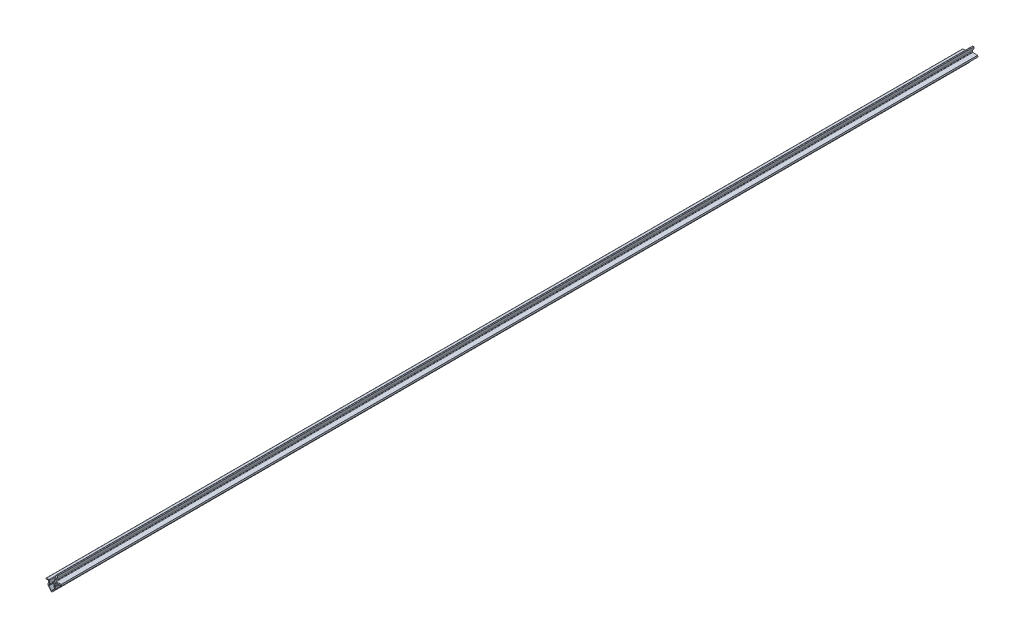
ISO-10303-21;
HEADER;
FILE_DESCRIPTION(('STEP AP214'),'2;1');
FILE_NAME('part.step','',(''),(''),'','','');
FILE_SCHEMA(('AUTOMOTIVE_DESIGN { 1 0 10303 214 1 1 1 1 }'));
ENDSEC;
DATA;
#1=APPLICATION_CONTEXT('core data for automotive mechanical design processes');
#2=APPLICATION_PROTOCOL_DEFINITION('international standard','automotive_design',2000,#1);
#3=PRODUCT_CONTEXT('',#1,'mechanical');
#4=PRODUCT('Part','Part','',(#3));
#5=PRODUCT_RELATED_PRODUCT_CATEGORY('part','',(#4));
#6=PRODUCT_DEFINITION_FORMATION('','',#4);
#7=PRODUCT_DEFINITION_CONTEXT('part definition',#1,'design');
#8=PRODUCT_DEFINITION('design','',#6,#7);
#9=PRODUCT_DEFINITION_SHAPE('','',#8);
#10=(LENGTH_UNIT() NAMED_UNIT(*) SI_UNIT(.MILLI.,.METRE.));
#11=(NAMED_UNIT(*) PLANE_ANGLE_UNIT() SI_UNIT($,.RADIAN.));
#12=(NAMED_UNIT(*) SI_UNIT($,.STERADIAN.) SOLID_ANGLE_UNIT());
#13=UNCERTAINTY_MEASURE_WITH_UNIT(LENGTH_MEASURE(1.E-05),#10,'distance_accuracy_value','');
#14=(GEOMETRIC_REPRESENTATION_CONTEXT(3) GLOBAL_UNCERTAINTY_ASSIGNED_CONTEXT((#13)) GLOBAL_UNIT_ASSIGNED_CONTEXT((#10,
#11,#12)) REPRESENTATION_CONTEXT('',''));
#15=CARTESIAN_POINT('',(0.,0.,0.));
#16=DIRECTION('',(0.,0.,1.));
#17=DIRECTION('',(1.,0.,0.));
#18=AXIS2_PLACEMENT_3D('',#15,#16,#17);
#19=CARTESIAN_POINT('',(-1.4232799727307,6.00000000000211,1000.));
#20=DIRECTION('',(-0.996547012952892,0.0830304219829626,0.));
#21=DIRECTION('',(-0.0830304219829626,-0.996547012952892,0.));
#22=AXIS2_PLACEMENT_3D('',#19,#20,#21);
#23=PLANE('',#22);
#24=DIRECTION('',(0.0830304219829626,0.996547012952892,0.));
#25=VECTOR('',#24,1.);
#26=CARTESIAN_POINT('',(-1.4232799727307,6.00000000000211,0.));
#27=LINE('',#26,#25);
#28=CARTESIAN_POINT('',(-1.62324345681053,3.59999999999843,0.));
#29=VERTEX_POINT('',#28);
#30=CARTESIAN_POINT('',(-1.4232799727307,6.00000000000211,0.));
#31=VERTEX_POINT('',#30);
#32=EDGE_CURVE('E437',#29,#31,#27,.T.);
#33=ORIENTED_EDGE('',*,*,#32,.T.);
#34=DIRECTION('',(0.,0.,-1.));
#35=VECTOR('',#34,1.);
#36=CARTESIAN_POINT('',(-1.4232799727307,6.00000000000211,1000.));
#37=LINE('',#36,#35);
#38=CARTESIAN_POINT('',(-1.4232799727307,6.00000000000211,1000.));
#39=VERTEX_POINT('',#38);
#40=EDGE_CURVE('E11',#39,#31,#37,.T.);
#41=ORIENTED_EDGE('',*,*,#40,.F.);
#42=DIRECTION('',(0.0830304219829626,0.996547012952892,0.));
#43=VECTOR('',#42,1.);
#44=CARTESIAN_POINT('',(-1.4232799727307,6.00000000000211,1000.));
#45=LINE('',#44,#43);
#46=CARTESIAN_POINT('',(-1.62324345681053,3.59999999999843,1000.));
#47=VERTEX_POINT('',#46);
#48=EDGE_CURVE('E553',#47,#39,#45,.T.);
#49=ORIENTED_EDGE('',*,*,#48,.F.);
#50=DIRECTION('',(0.,0.,-1.));
#51=VECTOR('',#50,1.);
#52=CARTESIAN_POINT('',(-1.62324345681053,3.59999999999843,1000.));
#53=LINE('',#52,#51);
#54=EDGE_CURVE('E433',#47,#29,#53,.T.);
#55=ORIENTED_EDGE('',*,*,#54,.T.);
#56=EDGE_LOOP('',(#33,#41,#49,#55));
#57=FACE_BOUND('',#56,.T.);
#58=ADVANCED_FACE('F35',(#57),#23,.F.);
#59=CARTESIAN_POINT('',(-2.4863172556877,6.00000000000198,1000.));
#60=DIRECTION('',(1.22389179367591E-13,-1.,0.));
#61=DIRECTION('',(1.,1.22389179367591E-13,0.));
#62=AXIS2_PLACEMENT_3D('',#59,#60,#61);
#63=PLANE('',#62);
#64=DIRECTION('',(-1.,-1.22389179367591E-13,0.));
#65=VECTOR('',#64,1.);
#66=CARTESIAN_POINT('',(-2.4863172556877,6.00000000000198,0.));
#67=LINE('',#66,#65);
#68=CARTESIAN_POINT('',(-2.4863172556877,6.00000000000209,0.));
#69=VERTEX_POINT('',#68);
#70=EDGE_CURVE('E440',#31,#69,#67,.T.);
#71=ORIENTED_EDGE('',*,*,#70,.T.);
#72=DIRECTION('',(0.,0.,-1.));
#73=VECTOR('',#72,1.);
#74=CARTESIAN_POINT('',(-2.4863172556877,6.00000000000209,1000.));
#75=LINE('',#74,#73);
#76=CARTESIAN_POINT('',(-2.4863172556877,6.00000000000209,1000.));
#77=VERTEX_POINT('',#76);
#78=EDGE_CURVE('E43',#77,#69,#75,.T.);
#79=ORIENTED_EDGE('',*,*,#78,.F.);
#80=DIRECTION('',(-1.,-1.22389179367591E-13,0.));
#81=VECTOR('',#80,1.);
#82=CARTESIAN_POINT('',(-2.4863172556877,6.00000000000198,1000.));
#83=LINE('',#82,#81);
#84=EDGE_CURVE('E247',#39,#77,#83,.T.);
#85=ORIENTED_EDGE('',*,*,#84,.F.);
#86=ORIENTED_EDGE('',*,*,#40,.T.);
#87=EDGE_LOOP('',(#71,#79,#85,#86));
#88=FACE_BOUND('',#87,.T.);
#89=ADVANCED_FACE('F866',(#88),#63,.F.);
#90=CARTESIAN_POINT('',(-2.4863172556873,5.00000000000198,1000.));
#91=DIRECTION('',(0.,0.,-1.));
#92=DIRECTION('',(-1.,0.,0.));
#93=AXIS2_PLACEMENT_3D('',#90,#91,#92);
#94=CYLINDRICAL_SURFACE('',#93,1.00000000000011);
#95=CARTESIAN_POINT('',(-2.4863172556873,5.00000000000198,0.));
#96=DIRECTION('',(0.,0.,1.));
#97=DIRECTION('',(1.,0.,0.));
#98=AXIS2_PLACEMENT_3D('',#95,#96,#97);
#99=CIRCLE('',#98,1.00000000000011);
#100=CARTESIAN_POINT('',(-3.4683333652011,5.18879714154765,0.));
#101=VERTEX_POINT('',#100);
#102=EDGE_CURVE('E442',#69,#101,#99,.T.);
#103=ORIENTED_EDGE('',*,*,#102,.T.);
#104=DIRECTION('',(0.,0.,-1.));
#105=VECTOR('',#104,1.);
#106=CARTESIAN_POINT('',(-3.4683333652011,5.18879714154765,1000.));
#107=LINE('',#106,#105);
#108=CARTESIAN_POINT('',(-3.4683333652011,5.18879714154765,1000.));
#109=VERTEX_POINT('',#108);
#110=EDGE_CURVE('E713',#109,#101,#107,.T.);
#111=ORIENTED_EDGE('',*,*,#110,.F.);
#112=CARTESIAN_POINT('',(-2.4863172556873,5.00000000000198,1000.));
#113=DIRECTION('',(0.,0.,1.));
#114=DIRECTION('',(1.,0.,0.));
#115=AXIS2_PLACEMENT_3D('',#112,#113,#114);
#116=CIRCLE('',#115,1.00000000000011);
#117=EDGE_CURVE('E721',#77,#109,#116,.T.);
#118=ORIENTED_EDGE('',*,*,#117,.F.);
#119=ORIENTED_EDGE('',*,*,#78,.T.);
#120=EDGE_LOOP('',(#103,#111,#118,#119));
#121=FACE_BOUND('',#120,.T.);
#122=ADVANCED_FACE('F719',(#121),#94,.T.);
#123=CARTESIAN_POINT('',(-4.67666577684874,-1.09626567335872,1000.));
#124=DIRECTION('',(0.982016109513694,-0.188797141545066,0.));
#125=DIRECTION('',(0.188797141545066,0.982016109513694,0.));
#126=AXIS2_PLACEMENT_3D('',#123,#124,#125);
#127=PLANE('',#126);
#128=DIRECTION('',(-0.188797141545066,-0.982016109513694,0.));
#129=VECTOR('',#128,1.);
#130=CARTESIAN_POINT('',(-4.67666577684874,-1.09626567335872,0.));
#131=LINE('',#130,#129);
#132=CARTESIAN_POINT('',(-4.67666577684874,-1.09626567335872,0.));
#133=VERTEX_POINT('',#132);
#134=EDGE_CURVE('E444',#101,#133,#131,.T.);
#135=ORIENTED_EDGE('',*,*,#134,.T.);
#136=DIRECTION('',(0.,0.,-1.));
#137=VECTOR('',#136,1.);
#138=CARTESIAN_POINT('',(-4.67666577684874,-1.09626567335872,1000.));
#139=LINE('',#138,#137);
#140=CARTESIAN_POINT('',(-4.67666577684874,-1.09626567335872,1000.));
#141=VERTEX_POINT('',#140);
#142=EDGE_CURVE('E710',#141,#133,#139,.T.);
#143=ORIENTED_EDGE('',*,*,#142,.F.);
#144=DIRECTION('',(-0.188797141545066,-0.982016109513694,0.));
#145=VECTOR('',#144,1.);
#146=CARTESIAN_POINT('',(-4.67666577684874,-1.09626567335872,1000.));
#147=LINE('',#146,#145);
#148=EDGE_CURVE('E739',#109,#141,#147,.T.);
#149=ORIENTED_EDGE('',*,*,#148,.F.);
#150=ORIENTED_EDGE('',*,*,#110,.T.);
#151=EDGE_LOOP('',(#135,#143,#149,#150));
#152=FACE_BOUND('',#151,.T.);
#153=ADVANCED_FACE('F730',(#152),#127,.F.);
#154=CARTESIAN_POINT('',(-5.16767383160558,-1.00186710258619,1000.));
#155=DIRECTION('',(0.,0.,-1.));
#156=DIRECTION('',(-1.,0.,0.));
#157=AXIS2_PLACEMENT_3D('',#154,#155,#156);
#158=CYLINDRICAL_SURFACE('',#157,0.499999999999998);
#159=CARTESIAN_POINT('',(-5.16767383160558,-1.00186710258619,0.));
#160=DIRECTION('',(0.,0.,-1.));
#161=DIRECTION('',(1.,0.,0.));
#162=AXIS2_PLACEMENT_3D('',#159,#160,#161);
#163=CIRCLE('',#162,0.499999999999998);
#164=CARTESIAN_POINT('',(-4.94968368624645,-1.45184520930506,0.));
#165=VERTEX_POINT('',#164);
#166=EDGE_CURVE('E446',#133,#165,#163,.T.);
#167=ORIENTED_EDGE('',*,*,#166,.T.);
#168=DIRECTION('',(0.,0.,-1.));
#169=VECTOR('',#168,1.);
#170=CARTESIAN_POINT('',(-4.94968368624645,-1.45184520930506,1000.));
#171=LINE('',#170,#169);
#172=CARTESIAN_POINT('',(-4.94968368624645,-1.45184520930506,1000.));
#173=VERTEX_POINT('',#172);
#174=EDGE_CURVE('E707',#173,#165,#171,.T.);
#175=ORIENTED_EDGE('',*,*,#174,.F.);
#176=CARTESIAN_POINT('',(-5.16767383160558,-1.00186710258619,1000.));
#177=DIRECTION('',(0.,0.,-1.));
#178=DIRECTION('',(1.,0.,0.));
#179=AXIS2_PLACEMENT_3D('',#176,#177,#178);
#180=CIRCLE('',#179,0.499999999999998);
#181=EDGE_CURVE('E736',#141,#173,#180,.T.);
#182=ORIENTED_EDGE('',*,*,#181,.F.);
#183=ORIENTED_EDGE('',*,*,#142,.T.);
#184=EDGE_LOOP('',(#167,#175,#182,#183));
#185=FACE_BOUND('',#184,.T.);
#186=ADVANCED_FACE('F734',(#185),#158,.F.);
#187=CARTESIAN_POINT('',(-4.73169354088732,-1.90182331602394,1000.));
#188=DIRECTION('',(0.,0.,-1.));
#189=DIRECTION('',(-1.,0.,0.));
#190=AXIS2_PLACEMENT_3D('',#187,#188,#189);
#191=CYLINDRICAL_SURFACE('',#190,0.500000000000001);
#192=CARTESIAN_POINT('',(-4.73169354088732,-1.90182331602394,0.));
#193=DIRECTION('',(0.,0.,1.));
#194=DIRECTION('',(1.,0.,0.));
#195=AXIS2_PLACEMENT_3D('',#192,#193,#194);
#196=CIRCLE('',#195,0.500000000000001);
#197=CARTESIAN_POINT('',(-5.23169354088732,-1.90182331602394,0.));
#198=VERTEX_POINT('',#197);
#199=EDGE_CURVE('E448',#165,#198,#196,.T.);
#200=ORIENTED_EDGE('',*,*,#199,.T.);
#201=DIRECTION('',(0.,0.,-1.));
#202=VECTOR('',#201,1.);
#203=CARTESIAN_POINT('',(-5.23169354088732,-1.90182331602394,1000.));
#204=LINE('',#203,#202);
#205=CARTESIAN_POINT('',(-5.23169354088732,-1.90182331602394,1000.));
#206=VERTEX_POINT('',#205);
#207=EDGE_CURVE('E704',#206,#198,#204,.T.);
#208=ORIENTED_EDGE('',*,*,#207,.F.);
#209=CARTESIAN_POINT('',(-4.73169354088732,-1.90182331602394,1000.));
#210=DIRECTION('',(0.,0.,1.));
#211=DIRECTION('',(1.,0.,0.));
#212=AXIS2_PLACEMENT_3D('',#209,#210,#211);
#213=CIRCLE('',#212,0.500000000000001);
#214=EDGE_CURVE('E738',#173,#206,#213,.T.);
#215=ORIENTED_EDGE('',*,*,#214,.F.);
#216=ORIENTED_EDGE('',*,*,#174,.T.);
#217=EDGE_LOOP('',(#200,#208,#215,#216));
#218=FACE_BOUND('',#217,.T.);
#219=ADVANCED_FACE('F879',(#218),#191,.T.);
#220=CARTESIAN_POINT('',(-5.23169354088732,-1.90182331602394,1000.));
#221=DIRECTION('',(1.,0.,0.));
#222=DIRECTION('',(0.,0.,-1.));
#223=AXIS2_PLACEMENT_3D('',#220,#221,#222);
#224=PLANE('',#223);
#225=DIRECTION('',(0.,-1.,0.));
#226=VECTOR('',#225,1.);
#227=CARTESIAN_POINT('',(-5.23169354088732,-1.90182331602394,0.));
#228=LINE('',#227,#226);
#229=CARTESIAN_POINT('',(-5.23169354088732,-6.01649756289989,0.));
#230=VERTEX_POINT('',#229);
#231=EDGE_CURVE('E450',#198,#230,#228,.T.);
#232=ORIENTED_EDGE('',*,*,#231,.T.);
#233=DIRECTION('',(0.,0.,-1.));
#234=VECTOR('',#233,1.);
#235=CARTESIAN_POINT('',(-5.23169354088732,-6.01649756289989,1000.));
#236=LINE('',#235,#234);
#237=CARTESIAN_POINT('',(-5.23169354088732,-6.01649756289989,1000.));
#238=VERTEX_POINT('',#237);
#239=EDGE_CURVE('E701',#238,#230,#236,.T.);
#240=ORIENTED_EDGE('',*,*,#239,.F.);
#241=DIRECTION('',(0.,-1.,0.));
#242=VECTOR('',#241,1.);
#243=CARTESIAN_POINT('',(-5.23169354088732,-1.90182331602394,1000.));
#244=LINE('',#243,#242);
#245=EDGE_CURVE('E741',#206,#238,#244,.T.);
#246=ORIENTED_EDGE('',*,*,#245,.F.);
#247=ORIENTED_EDGE('',*,*,#207,.T.);
#248=EDGE_LOOP('',(#232,#240,#246,#247));
#249=FACE_BOUND('',#248,.T.);
#250=ADVANCED_FACE('F882',(#249),#224,.F.);
#251=CARTESIAN_POINT('',(-4.73169354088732,-6.01649756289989,1000.));
#252=DIRECTION('',(0.,0.,-1.));
#253=DIRECTION('',(-1.,0.,0.));
#254=AXIS2_PLACEMENT_3D('',#251,#252,#253);
#255=CYLINDRICAL_SURFACE('',#254,0.499999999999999);
#256=CARTESIAN_POINT('',(-4.73169354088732,-6.01649756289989,0.));
#257=DIRECTION('',(0.,0.,1.));
#258=DIRECTION('',(1.,0.,0.));
#259=AXIS2_PLACEMENT_3D('',#256,#257,#258);
#260=CIRCLE('',#259,0.499999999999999);
#261=CARTESIAN_POINT('',(-4.93169354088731,-6.47475513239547,0.));
#262=VERTEX_POINT('',#261);
#263=EDGE_CURVE('E452',#230,#262,#260,.T.);
#264=ORIENTED_EDGE('',*,*,#263,.T.);
#265=DIRECTION('',(0.,0.,-1.));
#266=VECTOR('',#265,1.);
#267=CARTESIAN_POINT('',(-4.93169354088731,-6.47475513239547,1000.));
#268=LINE('',#267,#266);
#269=CARTESIAN_POINT('',(-4.93169354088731,-6.47475513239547,1000.));
#270=VERTEX_POINT('',#269);
#271=EDGE_CURVE('E698',#270,#262,#268,.T.);
#272=ORIENTED_EDGE('',*,*,#271,.F.);
#273=CARTESIAN_POINT('',(-4.73169354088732,-6.01649756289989,1000.));
#274=DIRECTION('',(0.,0.,1.));
#275=DIRECTION('',(1.,0.,0.));
#276=AXIS2_PLACEMENT_3D('',#273,#274,#275);
#277=CIRCLE('',#276,0.499999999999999);
#278=EDGE_CURVE('E747',#238,#270,#277,.T.);
#279=ORIENTED_EDGE('',*,*,#278,.F.);
#280=ORIENTED_EDGE('',*,*,#239,.T.);
#281=EDGE_LOOP('',(#264,#272,#279,#280));
#282=FACE_BOUND('',#281,.T.);
#283=ADVANCED_FACE('F886',(#282),#255,.T.);
#284=CARTESIAN_POINT('',(-5.1316935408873,-6.93301270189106,1000.));
#285=DIRECTION('',(0.,0.,-1.));
#286=DIRECTION('',(-1.,0.,0.));
#287=AXIS2_PLACEMENT_3D('',#284,#285,#286);
#288=CYLINDRICAL_SURFACE('',#287,0.5);
#289=CARTESIAN_POINT('',(-5.1316935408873,-6.93301270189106,0.));
#290=DIRECTION('',(0.,0.,-1.));
#291=DIRECTION('',(1.,0.,0.));
#292=AXIS2_PLACEMENT_3D('',#289,#290,#291);
#293=CIRCLE('',#292,0.5);
#294=CARTESIAN_POINT('',(-4.6316935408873,-6.93301270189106,0.));
#295=VERTEX_POINT('',#294);
#296=EDGE_CURVE('E454',#262,#295,#293,.T.);
#297=ORIENTED_EDGE('',*,*,#296,.T.);
#298=DIRECTION('',(0.,0.,-1.));
#299=VECTOR('',#298,1.);
#300=CARTESIAN_POINT('',(-4.6316935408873,-6.93301270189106,1000.));
#301=LINE('',#300,#299);
#302=CARTESIAN_POINT('',(-4.6316935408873,-6.93301270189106,1000.));
#303=VERTEX_POINT('',#302);
#304=EDGE_CURVE('E695',#303,#295,#301,.T.);
#305=ORIENTED_EDGE('',*,*,#304,.F.);
#306=CARTESIAN_POINT('',(-5.1316935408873,-6.93301270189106,1000.));
#307=DIRECTION('',(0.,0.,-1.));
#308=DIRECTION('',(1.,0.,0.));
#309=AXIS2_PLACEMENT_3D('',#306,#307,#308);
#310=CIRCLE('',#309,0.5);
#311=EDGE_CURVE('E749',#270,#303,#310,.T.);
#312=ORIENTED_EDGE('',*,*,#311,.F.);
#313=ORIENTED_EDGE('',*,*,#271,.T.);
#314=EDGE_LOOP('',(#297,#305,#312,#313));
#315=FACE_BOUND('',#314,.T.);
#316=ADVANCED_FACE('F890',(#315),#288,.F.);
#317=CARTESIAN_POINT('',(-4.6316935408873,-6.93301270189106,1000.));
#318=DIRECTION('',(1.,0.,0.));
#319=DIRECTION('',(0.,1.,0.));
#320=AXIS2_PLACEMENT_3D('',#317,#318,#319);
#321=PLANE('',#320);
#322=DIRECTION('',(0.,-1.,0.));
#323=VECTOR('',#322,1.);
#324=CARTESIAN_POINT('',(-4.6316935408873,-6.93301270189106,0.));
#325=LINE('',#324,#323);
#326=CARTESIAN_POINT('',(-4.63169354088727,-7.64490613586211,0.));
#327=VERTEX_POINT('',#326);
#328=EDGE_CURVE('E456',#295,#327,#325,.T.);
#329=ORIENTED_EDGE('',*,*,#328,.T.);
#330=DIRECTION('',(0.,0.,-1.));
#331=VECTOR('',#330,1.);
#332=CARTESIAN_POINT('',(-4.63169354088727,-7.64490613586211,1000.));
#333=LINE('',#332,#331);
#334=CARTESIAN_POINT('',(-4.63169354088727,-7.64490613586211,1000.));
#335=VERTEX_POINT('',#334);
#336=EDGE_CURVE('E692',#335,#327,#333,.T.);
#337=ORIENTED_EDGE('',*,*,#336,.F.);
#338=DIRECTION('',(0.,-1.,0.));
#339=VECTOR('',#338,1.);
#340=CARTESIAN_POINT('',(-4.6316935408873,-6.93301270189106,1000.));
#341=LINE('',#340,#339);
#342=EDGE_CURVE('E751',#303,#335,#341,.T.);
#343=ORIENTED_EDGE('',*,*,#342,.F.);
#344=ORIENTED_EDGE('',*,*,#304,.T.);
#345=EDGE_LOOP('',(#329,#337,#343,#344));
#346=FACE_BOUND('',#345,.T.);
#347=ADVANCED_FACE('F894',(#346),#321,.F.);
#348=CARTESIAN_POINT('',(-5.13169354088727,-7.64490613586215,1000.));
#349=DIRECTION('',(0.,0.,-1.));
#350=DIRECTION('',(-1.,0.,0.));
#351=AXIS2_PLACEMENT_3D('',#348,#349,#350);
#352=CYLINDRICAL_SURFACE('',#351,0.499999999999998);
#353=CARTESIAN_POINT('',(-5.13169354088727,-7.64490613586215,0.));
#354=DIRECTION('',(0.,0.,-1.));
#355=DIRECTION('',(1.,0.,0.));
#356=AXIS2_PLACEMENT_3D('',#353,#354,#355);
#357=CIRCLE('',#356,0.499999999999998);
#358=CARTESIAN_POINT('',(-4.74505964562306,-7.96194592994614,0.));
#359=VERTEX_POINT('',#358);
#360=EDGE_CURVE('E458',#327,#359,#357,.T.);
#361=ORIENTED_EDGE('',*,*,#360,.T.);
#362=DIRECTION('',(0.,0.,-1.));
#363=VECTOR('',#362,1.);
#364=CARTESIAN_POINT('',(-4.74505964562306,-7.96194592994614,1000.));
#365=LINE('',#364,#363);
#366=CARTESIAN_POINT('',(-4.74505964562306,-7.96194592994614,1000.));
#367=VERTEX_POINT('',#366);
#368=EDGE_CURVE('E689',#367,#359,#365,.T.);
#369=ORIENTED_EDGE('',*,*,#368,.F.);
#370=CARTESIAN_POINT('',(-5.13169354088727,-7.64490613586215,1000.));
#371=DIRECTION('',(0.,0.,-1.));
#372=DIRECTION('',(1.,0.,0.));
#373=AXIS2_PLACEMENT_3D('',#370,#371,#372);
#374=CIRCLE('',#373,0.499999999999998);
#375=EDGE_CURVE('E753',#335,#367,#374,.T.);
#376=ORIENTED_EDGE('',*,*,#375,.F.);
#377=ORIENTED_EDGE('',*,*,#336,.T.);
#378=EDGE_LOOP('',(#361,#369,#376,#377));
#379=FACE_BOUND('',#378,.T.);
#380=ADVANCED_FACE('F898',(#379),#352,.F.);
#381=CARTESIAN_POINT('',(-4.74505964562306,-7.96194592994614,1000.));
#382=DIRECTION('',(0.773267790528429,-0.634079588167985,0.));
#383=DIRECTION('',(0.634079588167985,0.773267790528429,0.));
#384=AXIS2_PLACEMENT_3D('',#381,#382,#383);
#385=PLANE('',#384);
#386=DIRECTION('',(-0.634079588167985,-0.773267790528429,0.));
#387=VECTOR('',#386,1.);
#388=CARTESIAN_POINT('',(-4.74505964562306,-7.96194592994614,0.));
#389=LINE('',#388,#387);
#390=CARTESIAN_POINT('',(-7.2950596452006,-11.0717020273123,0.));
#391=VERTEX_POINT('',#390);
#392=EDGE_CURVE('E460',#359,#391,#389,.T.);
#393=ORIENTED_EDGE('',*,*,#392,.T.);
#394=DIRECTION('',(0.,0.,-1.));
#395=VECTOR('',#394,1.);
#396=CARTESIAN_POINT('',(-7.2950596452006,-11.0717020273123,1000.));
#397=LINE('',#396,#395);
#398=CARTESIAN_POINT('',(-7.2950596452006,-11.0717020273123,1000.));
#399=VERTEX_POINT('',#398);
#400=EDGE_CURVE('E686',#399,#391,#397,.T.);
#401=ORIENTED_EDGE('',*,*,#400,.F.);
#402=DIRECTION('',(-0.634079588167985,-0.773267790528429,0.));
#403=VECTOR('',#402,1.);
#404=CARTESIAN_POINT('',(-4.74505964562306,-7.96194592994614,1000.));
#405=LINE('',#404,#403);
#406=EDGE_CURVE('E755',#367,#399,#405,.T.);
#407=ORIENTED_EDGE('',*,*,#406,.F.);
#408=ORIENTED_EDGE('',*,*,#368,.T.);
#409=EDGE_LOOP('',(#393,#401,#407,#408));
#410=FACE_BOUND('',#409,.T.);
#411=ADVANCED_FACE('F902',(#410),#385,.F.);
#412=CARTESIAN_POINT('',(-7.68169354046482,-10.7546622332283,1000.));
#413=DIRECTION('',(0.,0.,-1.));
#414=DIRECTION('',(-1.,0.,0.));
#415=AXIS2_PLACEMENT_3D('',#412,#413,#414);
#416=CYLINDRICAL_SURFACE('',#415,0.50000000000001);
#417=CARTESIAN_POINT('',(-7.68169354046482,-10.7546622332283,0.));
#418=DIRECTION('',(0.,0.,-1.));
#419=DIRECTION('',(1.,0.,0.));
#420=AXIS2_PLACEMENT_3D('',#417,#418,#419);
#421=CIRCLE('',#420,0.50000000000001);
#422=CARTESIAN_POINT('',(-8.06832743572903,-11.0717020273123,0.));
#423=VERTEX_POINT('',#422);
#424=EDGE_CURVE('E462',#391,#423,#421,.T.);
#425=ORIENTED_EDGE('',*,*,#424,.T.);
#426=DIRECTION('',(0.,0.,-1.));
#427=VECTOR('',#426,1.);
#428=CARTESIAN_POINT('',(-8.06832743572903,-11.0717020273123,1000.));
#429=LINE('',#428,#427);
#430=CARTESIAN_POINT('',(-8.06832743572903,-11.0717020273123,1000.));
#431=VERTEX_POINT('',#430);
#432=EDGE_CURVE('E683',#431,#423,#429,.T.);
#433=ORIENTED_EDGE('',*,*,#432,.F.);
#434=CARTESIAN_POINT('',(-7.68169354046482,-10.7546622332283,1000.));
#435=DIRECTION('',(0.,0.,-1.));
#436=DIRECTION('',(1.,0.,0.));
#437=AXIS2_PLACEMENT_3D('',#434,#435,#436);
#438=CIRCLE('',#437,0.50000000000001);
#439=EDGE_CURVE('E757',#399,#431,#438,.T.);
#440=ORIENTED_EDGE('',*,*,#439,.F.);
#441=ORIENTED_EDGE('',*,*,#400,.T.);
#442=EDGE_LOOP('',(#425,#433,#440,#441));
#443=FACE_BOUND('',#442,.T.);
#444=ADVANCED_FACE('F906',(#443),#416,.F.);
#445=CARTESIAN_POINT('',(-8.06832743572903,-11.0717020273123,1000.));
#446=DIRECTION('',(-0.773267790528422,-0.634079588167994,0.));
#447=DIRECTION('',(0.634079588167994,-0.773267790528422,0.));
#448=AXIS2_PLACEMENT_3D('',#445,#446,#447);
#449=PLANE('',#448);
#450=DIRECTION('',(-0.634079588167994,0.773267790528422,0.));
#451=VECTOR('',#450,1.);
#452=CARTESIAN_POINT('',(-8.06832743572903,-11.0717020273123,0.));
#453=LINE('',#452,#451);
#454=CARTESIAN_POINT('',(-10.6183274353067,-7.96194592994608,0.));
#455=VERTEX_POINT('',#454);
#456=EDGE_CURVE('E464',#423,#455,#453,.T.);
#457=ORIENTED_EDGE('',*,*,#456,.T.);
#458=DIRECTION('',(0.,0.,-1.));
#459=VECTOR('',#458,1.);
#460=CARTESIAN_POINT('',(-10.6183274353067,-7.96194592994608,1000.));
#461=LINE('',#460,#459);
#462=CARTESIAN_POINT('',(-10.6183274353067,-7.96194592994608,1000.));
#463=VERTEX_POINT('',#462);
#464=EDGE_CURVE('E680',#463,#455,#461,.T.);
#465=ORIENTED_EDGE('',*,*,#464,.F.);
#466=DIRECTION('',(-0.634079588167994,0.773267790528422,0.));
#467=VECTOR('',#466,1.);
#468=CARTESIAN_POINT('',(-8.06832743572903,-11.0717020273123,1000.));
#469=LINE('',#468,#467);
#470=EDGE_CURVE('E759',#431,#463,#469,.T.);
#471=ORIENTED_EDGE('',*,*,#470,.F.);
#472=ORIENTED_EDGE('',*,*,#432,.T.);
#473=EDGE_LOOP('',(#457,#465,#471,#472));
#474=FACE_BOUND('',#473,.T.);
#475=ADVANCED_FACE('F910',(#474),#449,.F.);
#476=CARTESIAN_POINT('',(-10.2316935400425,-7.64490613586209,1000.));
#477=DIRECTION('',(0.,0.,-1.));
#478=DIRECTION('',(-1.,0.,0.));
#479=AXIS2_PLACEMENT_3D('',#476,#477,#478);
#480=CYLINDRICAL_SURFACE('',#479,0.500000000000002);
#481=CARTESIAN_POINT('',(-10.2316935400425,-7.64490613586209,0.));
#482=DIRECTION('',(0.,0.,-1.));
#483=DIRECTION('',(1.,0.,0.));
#484=AXIS2_PLACEMENT_3D('',#481,#482,#483);
#485=CIRCLE('',#484,0.500000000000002);
#486=CARTESIAN_POINT('',(-10.7316935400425,-7.64490613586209,0.));
#487=VERTEX_POINT('',#486);
#488=EDGE_CURVE('E466',#455,#487,#485,.T.);
#489=ORIENTED_EDGE('',*,*,#488,.T.);
#490=DIRECTION('',(0.,0.,-1.));
#491=VECTOR('',#490,1.);
#492=CARTESIAN_POINT('',(-10.7316935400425,-7.64490613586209,1000.));
#493=LINE('',#492,#491);
#494=CARTESIAN_POINT('',(-10.7316935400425,-7.64490613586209,1000.));
#495=VERTEX_POINT('',#494);
#496=EDGE_CURVE('E677',#495,#487,#493,.T.);
#497=ORIENTED_EDGE('',*,*,#496,.F.);
#498=CARTESIAN_POINT('',(-10.2316935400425,-7.64490613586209,1000.));
#499=DIRECTION('',(0.,0.,-1.));
#500=DIRECTION('',(1.,0.,0.));
#501=AXIS2_PLACEMENT_3D('',#498,#499,#500);
#502=CIRCLE('',#501,0.500000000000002);
#503=EDGE_CURVE('E761',#463,#495,#502,.T.);
#504=ORIENTED_EDGE('',*,*,#503,.F.);
#505=ORIENTED_EDGE('',*,*,#464,.T.);
#506=EDGE_LOOP('',(#489,#497,#504,#505));
#507=FACE_BOUND('',#506,.T.);
#508=ADVANCED_FACE('F914',(#507),#480,.F.);
#509=CARTESIAN_POINT('',(-10.7316935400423,-6.93301270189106,1000.));
#510=DIRECTION('',(-1.,1.55953541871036E-13,0.));
#511=DIRECTION('',(-1.55953541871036E-13,-1.,0.));
#512=AXIS2_PLACEMENT_3D('',#509,#510,#511);
#513=PLANE('',#512);
#514=DIRECTION('',(1.55953541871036E-13,1.,0.));
#515=VECTOR('',#514,1.);
#516=CARTESIAN_POINT('',(-10.7316935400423,-6.93301270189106,0.));
#517=LINE('',#516,#515);
#518=CARTESIAN_POINT('',(-10.7316935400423,-6.93301270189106,0.));
#519=VERTEX_POINT('',#518);
#520=EDGE_CURVE('E468',#487,#519,#517,.T.);
#521=ORIENTED_EDGE('',*,*,#520,.T.);
#522=DIRECTION('',(0.,0.,-1.));
#523=VECTOR('',#522,1.);
#524=CARTESIAN_POINT('',(-10.7316935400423,-6.93301270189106,1000.));
#525=LINE('',#524,#523);
#526=CARTESIAN_POINT('',(-10.7316935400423,-6.93301270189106,1000.));
#527=VERTEX_POINT('',#526);
#528=EDGE_CURVE('E674',#527,#519,#525,.T.);
#529=ORIENTED_EDGE('',*,*,#528,.F.);
#530=DIRECTION('',(1.55953541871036E-13,1.,0.));
#531=VECTOR('',#530,1.);
#532=CARTESIAN_POINT('',(-10.7316935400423,-6.93301270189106,1000.));
#533=LINE('',#532,#531);
#534=EDGE_CURVE('E763',#495,#527,#533,.T.);
#535=ORIENTED_EDGE('',*,*,#534,.F.);
#536=ORIENTED_EDGE('',*,*,#496,.T.);
#537=EDGE_LOOP('',(#521,#529,#535,#536));
#538=FACE_BOUND('',#537,.T.);
#539=ADVANCED_FACE('F918',(#538),#513,.F.);
#540=CARTESIAN_POINT('',(-10.2316935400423,-6.93301270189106,1000.));
#541=DIRECTION('',(0.,0.,-1.));
#542=DIRECTION('',(-1.,0.,0.));
#543=AXIS2_PLACEMENT_3D('',#540,#541,#542);
#544=CYLINDRICAL_SURFACE('',#543,0.499999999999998);
#545=CARTESIAN_POINT('',(-10.2316935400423,-6.93301270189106,0.));
#546=DIRECTION('',(0.,0.,-1.));
#547=DIRECTION('',(1.,0.,0.));
#548=AXIS2_PLACEMENT_3D('',#545,#546,#547);
#549=CIRCLE('',#548,0.499999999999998);
#550=CARTESIAN_POINT('',(-10.4316935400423,-6.47475513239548,0.));
#551=VERTEX_POINT('',#550);
#552=EDGE_CURVE('E470',#519,#551,#549,.T.);
#553=ORIENTED_EDGE('',*,*,#552,.T.);
#554=DIRECTION('',(0.,0.,-1.));
#555=VECTOR('',#554,1.);
#556=CARTESIAN_POINT('',(-10.4316935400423,-6.47475513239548,1000.));
#557=LINE('',#556,#555);
#558=CARTESIAN_POINT('',(-10.4316935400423,-6.47475513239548,1000.));
#559=VERTEX_POINT('',#558);
#560=EDGE_CURVE('E671',#559,#551,#557,.T.);
#561=ORIENTED_EDGE('',*,*,#560,.F.);
#562=CARTESIAN_POINT('',(-10.2316935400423,-6.93301270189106,1000.));
#563=DIRECTION('',(0.,0.,-1.));
#564=DIRECTION('',(1.,0.,0.));
#565=AXIS2_PLACEMENT_3D('',#562,#563,#564);
#566=CIRCLE('',#565,0.499999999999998);
#567=EDGE_CURVE('E765',#527,#559,#566,.T.);
#568=ORIENTED_EDGE('',*,*,#567,.F.);
#569=ORIENTED_EDGE('',*,*,#528,.T.);
#570=EDGE_LOOP('',(#553,#561,#568,#569));
#571=FACE_BOUND('',#570,.T.);
#572=ADVANCED_FACE('F922',(#571),#544,.F.);
#573=CARTESIAN_POINT('',(-10.6316935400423,-6.01649756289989,1000.));
#574=DIRECTION('',(0.,0.,-1.));
#575=DIRECTION('',(-1.,0.,0.));
#576=AXIS2_PLACEMENT_3D('',#573,#574,#575);
#577=CYLINDRICAL_SURFACE('',#576,0.5);
#578=CARTESIAN_POINT('',(-10.6316935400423,-6.01649756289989,0.));
#579=DIRECTION('',(0.,0.,1.));
#580=DIRECTION('',(1.,0.,0.));
#581=AXIS2_PLACEMENT_3D('',#578,#579,#580);
#582=CIRCLE('',#581,0.5);
#583=CARTESIAN_POINT('',(-10.1316935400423,-6.01649756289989,0.));
#584=VERTEX_POINT('',#583);
#585=EDGE_CURVE('E472',#551,#584,#582,.T.);
#586=ORIENTED_EDGE('',*,*,#585,.T.);
#587=DIRECTION('',(0.,0.,-1.));
#588=VECTOR('',#587,1.);
#589=CARTESIAN_POINT('',(-10.1316935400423,-6.01649756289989,1000.));
#590=LINE('',#589,#588);
#591=CARTESIAN_POINT('',(-10.1316935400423,-6.01649756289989,1000.));
#592=VERTEX_POINT('',#591);
#593=EDGE_CURVE('E668',#592,#584,#590,.T.);
#594=ORIENTED_EDGE('',*,*,#593,.F.);
#595=CARTESIAN_POINT('',(-10.6316935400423,-6.01649756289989,1000.));
#596=DIRECTION('',(0.,0.,1.));
#597=DIRECTION('',(1.,0.,0.));
#598=AXIS2_PLACEMENT_3D('',#595,#596,#597);
#599=CIRCLE('',#598,0.5);
#600=EDGE_CURVE('E767',#559,#592,#599,.T.);
#601=ORIENTED_EDGE('',*,*,#600,.F.);
#602=ORIENTED_EDGE('',*,*,#560,.T.);
#603=EDGE_LOOP('',(#586,#594,#601,#602));
#604=FACE_BOUND('',#603,.T.);
#605=ADVANCED_FACE('F926',(#604),#577,.T.);
#606=CARTESIAN_POINT('',(-10.1316935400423,-2.49999999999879,1000.));
#607=DIRECTION('',(-1.,0.,0.));
#608=DIRECTION('',(0.,0.,1.));
#609=AXIS2_PLACEMENT_3D('',#606,#607,#608);
#610=PLANE('',#609);
#611=DIRECTION('',(0.,1.,0.));
#612=VECTOR('',#611,1.);
#613=CARTESIAN_POINT('',(-10.1316935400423,-2.49999999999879,0.));
#614=LINE('',#613,#612);
#615=CARTESIAN_POINT('',(-10.1316935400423,-2.49999999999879,0.));
#616=VERTEX_POINT('',#615);
#617=EDGE_CURVE('E474',#584,#616,#614,.T.);
#618=ORIENTED_EDGE('',*,*,#617,.T.);
#619=DIRECTION('',(0.,0.,-1.));
#620=VECTOR('',#619,1.);
#621=CARTESIAN_POINT('',(-10.1316935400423,-2.49999999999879,1000.));
#622=LINE('',#621,#620);
#623=CARTESIAN_POINT('',(-10.1316935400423,-2.49999999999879,1000.));
#624=VERTEX_POINT('',#623);
#625=EDGE_CURVE('E665',#624,#616,#622,.T.);
#626=ORIENTED_EDGE('',*,*,#625,.F.);
#627=DIRECTION('',(0.,1.,0.));
#628=VECTOR('',#627,1.);
#629=CARTESIAN_POINT('',(-10.1316935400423,-2.49999999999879,1000.));
#630=LINE('',#629,#628);
#631=EDGE_CURVE('E769',#592,#624,#630,.T.);
#632=ORIENTED_EDGE('',*,*,#631,.F.);
#633=ORIENTED_EDGE('',*,*,#593,.T.);
#634=EDGE_LOOP('',(#618,#626,#632,#633));
#635=FACE_BOUND('',#634,.T.);
#636=ADVANCED_FACE('F930',(#635),#610,.F.);
#637=CARTESIAN_POINT('',(-10.6316935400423,-2.49999999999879,1000.));
#638=DIRECTION('',(0.,0.,-1.));
#639=DIRECTION('',(-1.,0.,0.));
#640=AXIS2_PLACEMENT_3D('',#637,#638,#639);
#641=CYLINDRICAL_SURFACE('',#640,0.5);
#642=CARTESIAN_POINT('',(-10.6316935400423,-2.49999999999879,0.));
#643=DIRECTION('',(0.,0.,1.));
#644=DIRECTION('',(1.,0.,0.));
#645=AXIS2_PLACEMENT_3D('',#642,#643,#644);
#646=CIRCLE('',#645,0.5);
#647=CARTESIAN_POINT('',(-10.6316935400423,-1.99999999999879,0.));
#648=VERTEX_POINT('',#647);
#649=EDGE_CURVE('E476',#616,#648,#646,.T.);
#650=ORIENTED_EDGE('',*,*,#649,.T.);
#651=DIRECTION('',(0.,0.,-1.));
#652=VECTOR('',#651,1.);
#653=CARTESIAN_POINT('',(-10.6316935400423,-1.99999999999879,1000.));
#654=LINE('',#653,#652);
#655=CARTESIAN_POINT('',(-10.6316935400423,-1.99999999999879,1000.));
#656=VERTEX_POINT('',#655);
#657=EDGE_CURVE('E662',#656,#648,#654,.T.);
#658=ORIENTED_EDGE('',*,*,#657,.F.);
#659=CARTESIAN_POINT('',(-10.6316935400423,-2.49999999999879,1000.));
#660=DIRECTION('',(0.,0.,1.));
#661=DIRECTION('',(1.,0.,0.));
#662=AXIS2_PLACEMENT_3D('',#659,#660,#661);
#663=CIRCLE('',#662,0.5);
#664=EDGE_CURVE('E771',#624,#656,#663,.T.);
#665=ORIENTED_EDGE('',*,*,#664,.F.);
#666=ORIENTED_EDGE('',*,*,#625,.T.);
#667=EDGE_LOOP('',(#650,#658,#665,#666));
#668=FACE_BOUND('',#667,.T.);
#669=ADVANCED_FACE('F934',(#668),#641,.T.);
#670=CARTESIAN_POINT('',(-13.3816935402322,-1.99999999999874,1000.));
#671=DIRECTION('',(0.,-1.,0.));
#672=DIRECTION('',(1.,0.,0.));
#673=AXIS2_PLACEMENT_3D('',#670,#671,#672);
#674=PLANE('',#673);
#675=DIRECTION('',(-1.,0.,0.));
#676=VECTOR('',#675,1.);
#677=CARTESIAN_POINT('',(-13.3816935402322,-1.99999999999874,0.));
#678=LINE('',#677,#676);
#679=CARTESIAN_POINT('',(-13.3816935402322,-1.99999999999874,0.));
#680=VERTEX_POINT('',#679);
#681=EDGE_CURVE('E478',#648,#680,#678,.T.);
#682=ORIENTED_EDGE('',*,*,#681,.T.);
#683=DIRECTION('',(0.,0.,-1.));
#684=VECTOR('',#683,1.);
#685=CARTESIAN_POINT('',(-13.3816935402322,-1.99999999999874,1000.));
#686=LINE('',#685,#684);
#687=CARTESIAN_POINT('',(-13.3816935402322,-1.99999999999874,1000.));
#688=VERTEX_POINT('',#687);
#689=EDGE_CURVE('E659',#688,#680,#686,.T.);
#690=ORIENTED_EDGE('',*,*,#689,.F.);
#691=DIRECTION('',(-1.,0.,0.));
#692=VECTOR('',#691,1.);
#693=CARTESIAN_POINT('',(-13.3816935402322,-1.99999999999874,1000.));
#694=LINE('',#693,#692);
#695=EDGE_CURVE('E773',#656,#688,#694,.T.);
#696=ORIENTED_EDGE('',*,*,#695,.F.);
#697=ORIENTED_EDGE('',*,*,#657,.T.);
#698=EDGE_LOOP('',(#682,#690,#696,#697));
#699=FACE_BOUND('',#698,.T.);
#700=ADVANCED_FACE('F938',(#699),#674,.F.);
#701=CARTESIAN_POINT('',(-13.3816935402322,-2.49999999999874,1000.));
#702=DIRECTION('',(0.,0.,-1.));
#703=DIRECTION('',(-1.,0.,0.));
#704=AXIS2_PLACEMENT_3D('',#701,#702,#703);
#705=CYLINDRICAL_SURFACE('',#704,0.5);
#706=CARTESIAN_POINT('',(-13.3816935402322,-2.49999999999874,0.));
#707=DIRECTION('',(0.,0.,1.));
#708=DIRECTION('',(1.,0.,0.));
#709=AXIS2_PLACEMENT_3D('',#706,#707,#708);
#710=CIRCLE('',#709,0.5);
#711=CARTESIAN_POINT('',(-13.8816935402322,-2.49999999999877,0.));
#712=VERTEX_POINT('',#711);
#713=EDGE_CURVE('E480',#680,#712,#710,.T.);
#714=ORIENTED_EDGE('',*,*,#713,.T.);
#715=DIRECTION('',(0.,0.,-1.));
#716=VECTOR('',#715,1.);
#717=CARTESIAN_POINT('',(-13.8816935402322,-2.49999999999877,1000.));
#718=LINE('',#717,#716);
#719=CARTESIAN_POINT('',(-13.8816935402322,-2.49999999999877,1000.));
#720=VERTEX_POINT('',#719);
#721=EDGE_CURVE('E656',#720,#712,#718,.T.);
#722=ORIENTED_EDGE('',*,*,#721,.F.);
#723=CARTESIAN_POINT('',(-13.3816935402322,-2.49999999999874,1000.));
#724=DIRECTION('',(0.,0.,1.));
#725=DIRECTION('',(1.,0.,0.));
#726=AXIS2_PLACEMENT_3D('',#723,#724,#725);
#727=CIRCLE('',#726,0.5);
#728=EDGE_CURVE('E775',#688,#720,#727,.T.);
#729=ORIENTED_EDGE('',*,*,#728,.F.);
#730=ORIENTED_EDGE('',*,*,#689,.T.);
#731=EDGE_LOOP('',(#714,#722,#729,#730));
#732=FACE_BOUND('',#731,.T.);
#733=ADVANCED_FACE('F942',(#732),#705,.T.);
#734=CARTESIAN_POINT('',(-13.8816935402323,-2.9999999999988,1000.));
#735=DIRECTION('',(1.,-2.77555756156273E-13,0.));
#736=DIRECTION('',(2.77555756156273E-13,1.,0.));
#737=AXIS2_PLACEMENT_3D('',#734,#735,#736);
#738=PLANE('',#737);
#739=DIRECTION('',(-2.77555756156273E-13,-1.,0.));
#740=VECTOR('',#739,1.);
#741=CARTESIAN_POINT('',(-13.8816935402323,-2.9999999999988,0.));
#742=LINE('',#741,#740);
#743=CARTESIAN_POINT('',(-13.8816935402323,-2.9999999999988,0.));
#744=VERTEX_POINT('',#743);
#745=EDGE_CURVE('E482',#712,#744,#742,.T.);
#746=ORIENTED_EDGE('',*,*,#745,.T.);
#747=DIRECTION('',(0.,0.,-1.));
#748=VECTOR('',#747,1.);
#749=CARTESIAN_POINT('',(-13.8816935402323,-2.9999999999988,1000.));
#750=LINE('',#749,#748);
#751=CARTESIAN_POINT('',(-13.8816935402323,-2.9999999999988,1000.));
#752=VERTEX_POINT('',#751);
#753=EDGE_CURVE('E653',#752,#744,#750,.T.);
#754=ORIENTED_EDGE('',*,*,#753,.F.);
#755=DIRECTION('',(-2.77555756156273E-13,-1.,0.));
#756=VECTOR('',#755,1.);
#757=CARTESIAN_POINT('',(-13.8816935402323,-2.9999999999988,1000.));
#758=LINE('',#757,#756);
#759=EDGE_CURVE('E777',#720,#752,#758,.T.);
#760=ORIENTED_EDGE('',*,*,#759,.F.);
#761=ORIENTED_EDGE('',*,*,#721,.T.);
#762=EDGE_LOOP('',(#746,#754,#760,#761));
#763=FACE_BOUND('',#762,.T.);
#764=ADVANCED_FACE('F946',(#763),#738,.F.);
#765=CARTESIAN_POINT('',(-13.8816935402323,-2.9999999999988,1000.));
#766=DIRECTION('',(0.,1.,0.));
#767=DIRECTION('',(0.,0.,1.));
#768=AXIS2_PLACEMENT_3D('',#765,#766,#767);
#769=PLANE('',#768);
#770=DIRECTION('',(1.,0.,0.));
#771=VECTOR('',#770,1.);
#772=CARTESIAN_POINT('',(-13.8816935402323,-2.9999999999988,0.));
#773=LINE('',#772,#771);
#774=CARTESIAN_POINT('',(-11.4316935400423,-2.9999999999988,0.));
#775=VERTEX_POINT('',#774);
#776=EDGE_CURVE('E484',#744,#775,#773,.T.);
#777=ORIENTED_EDGE('',*,*,#776,.T.);
#778=DIRECTION('',(0.,0.,-1.));
#779=VECTOR('',#778,1.);
#780=CARTESIAN_POINT('',(-11.4316935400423,-2.9999999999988,1000.));
#781=LINE('',#780,#779);
#782=CARTESIAN_POINT('',(-11.4316935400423,-2.9999999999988,1000.));
#783=VERTEX_POINT('',#782);
#784=EDGE_CURVE('E650',#783,#775,#781,.T.);
#785=ORIENTED_EDGE('',*,*,#784,.F.);
#786=DIRECTION('',(1.,0.,0.));
#787=VECTOR('',#786,1.);
#788=CARTESIAN_POINT('',(-13.8816935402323,-2.9999999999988,1000.));
#789=LINE('',#788,#787);
#790=EDGE_CURVE('E779',#752,#783,#789,.T.);
#791=ORIENTED_EDGE('',*,*,#790,.F.);
#792=ORIENTED_EDGE('',*,*,#753,.T.);
#793=EDGE_LOOP('',(#777,#785,#791,#792));
#794=FACE_BOUND('',#793,.T.);
#795=ADVANCED_FACE('F950',(#794),#769,.F.);
#796=CARTESIAN_POINT('',(-11.4316935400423,-3.4999999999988,1000.));
#797=DIRECTION('',(0.,0.,-1.));
#798=DIRECTION('',(-1.,0.,0.));
#799=AXIS2_PLACEMENT_3D('',#796,#797,#798);
#800=CYLINDRICAL_SURFACE('',#799,0.5);
#801=CARTESIAN_POINT('',(-11.4316935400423,-3.4999999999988,0.));
#802=DIRECTION('',(0.,0.,-1.));
#803=DIRECTION('',(1.,0.,0.));
#804=AXIS2_PLACEMENT_3D('',#801,#802,#803);
#805=CIRCLE('',#804,0.5);
#806=CARTESIAN_POINT('',(-10.9316935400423,-3.4999999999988,0.));
#807=VERTEX_POINT('',#806);
#808=EDGE_CURVE('E486',#775,#807,#805,.T.);
#809=ORIENTED_EDGE('',*,*,#808,.T.);
#810=DIRECTION('',(0.,0.,-1.));
#811=VECTOR('',#810,1.);
#812=CARTESIAN_POINT('',(-10.9316935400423,-3.4999999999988,1000.));
#813=LINE('',#812,#811);
#814=CARTESIAN_POINT('',(-10.9316935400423,-3.4999999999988,1000.));
#815=VERTEX_POINT('',#814);
#816=EDGE_CURVE('E647',#815,#807,#813,.T.);
#817=ORIENTED_EDGE('',*,*,#816,.F.);
#818=CARTESIAN_POINT('',(-11.4316935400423,-3.4999999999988,1000.));
#819=DIRECTION('',(0.,0.,-1.));
#820=DIRECTION('',(1.,0.,0.));
#821=AXIS2_PLACEMENT_3D('',#818,#819,#820);
#822=CIRCLE('',#821,0.5);
#823=EDGE_CURVE('E781',#783,#815,#822,.T.);
#824=ORIENTED_EDGE('',*,*,#823,.F.);
#825=ORIENTED_EDGE('',*,*,#784,.T.);
#826=EDGE_LOOP('',(#809,#817,#824,#825));
#827=FACE_BOUND('',#826,.T.);
#828=ADVANCED_FACE('F954',(#827),#800,.F.);
#829=CARTESIAN_POINT('',(-10.9316935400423,-3.4999999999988,1000.));
#830=DIRECTION('',(1.,0.,0.));
#831=DIRECTION('',(0.,0.,-1.));
#832=AXIS2_PLACEMENT_3D('',#829,#830,#831);
#833=PLANE('',#832);
#834=DIRECTION('',(0.,-1.,0.));
#835=VECTOR('',#834,1.);
#836=CARTESIAN_POINT('',(-10.9316935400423,-3.4999999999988,0.));
#837=LINE('',#836,#835);
#838=CARTESIAN_POINT('',(-10.9316935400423,-4.94951026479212,0.));
#839=VERTEX_POINT('',#838);
#840=EDGE_CURVE('E488',#807,#839,#837,.T.);
#841=ORIENTED_EDGE('',*,*,#840,.T.);
#842=DIRECTION('',(0.,0.,-1.));
#843=VECTOR('',#842,1.);
#844=CARTESIAN_POINT('',(-10.9316935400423,-4.94951026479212,1000.));
#845=LINE('',#844,#843);
#846=CARTESIAN_POINT('',(-10.9316935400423,-4.94951026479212,1000.));
#847=VERTEX_POINT('',#846);
#848=EDGE_CURVE('E644',#847,#839,#845,.T.);
#849=ORIENTED_EDGE('',*,*,#848,.F.);
#850=DIRECTION('',(0.,-1.,0.));
#851=VECTOR('',#850,1.);
#852=CARTESIAN_POINT('',(-10.9316935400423,-3.4999999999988,1000.));
#853=LINE('',#852,#851);
#854=EDGE_CURVE('E783',#815,#847,#853,.T.);
#855=ORIENTED_EDGE('',*,*,#854,.F.);
#856=ORIENTED_EDGE('',*,*,#816,.T.);
#857=EDGE_LOOP('',(#841,#849,#855,#856));
#858=FACE_BOUND('',#857,.T.);
#859=ADVANCED_FACE('F958',(#858),#833,.F.);
#860=CARTESIAN_POINT('',(-11.4316935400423,-4.94951026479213,1000.));
#861=DIRECTION('',(0.,0.,-1.));
#862=DIRECTION('',(-1.,0.,0.));
#863=AXIS2_PLACEMENT_3D('',#860,#861,#862);
#864=CYLINDRICAL_SURFACE('',#863,0.499999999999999);
#865=CARTESIAN_POINT('',(-11.4316935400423,-4.94951026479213,0.));
#866=DIRECTION('',(0.,0.,-1.));
#867=DIRECTION('',(1.,0.,0.));
#868=AXIS2_PLACEMENT_3D('',#865,#866,#867);
#869=CIRCLE('',#868,0.499999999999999);
#870=CARTESIAN_POINT('',(-11.2316935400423,-5.40776783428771,0.));
#871=VERTEX_POINT('',#870);
#872=EDGE_CURVE('E490',#839,#871,#869,.T.);
#873=ORIENTED_EDGE('',*,*,#872,.T.);
#874=DIRECTION('',(0.,0.,-1.));
#875=VECTOR('',#874,1.);
#876=CARTESIAN_POINT('',(-11.2316935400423,-5.40776783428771,1000.));
#877=LINE('',#876,#875);
#878=CARTESIAN_POINT('',(-11.2316935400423,-5.40776783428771,1000.));
#879=VERTEX_POINT('',#878);
#880=EDGE_CURVE('E641',#879,#871,#877,.T.);
#881=ORIENTED_EDGE('',*,*,#880,.F.);
#882=CARTESIAN_POINT('',(-11.4316935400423,-4.94951026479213,1000.));
#883=DIRECTION('',(0.,0.,-1.));
#884=DIRECTION('',(1.,0.,0.));
#885=AXIS2_PLACEMENT_3D('',#882,#883,#884);
#886=CIRCLE('',#885,0.499999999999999);
#887=EDGE_CURVE('E785',#847,#879,#886,.T.);
#888=ORIENTED_EDGE('',*,*,#887,.F.);
#889=ORIENTED_EDGE('',*,*,#848,.T.);
#890=EDGE_LOOP('',(#873,#881,#888,#889));
#891=FACE_BOUND('',#890,.T.);
#892=ADVANCED_FACE('F962',(#891),#864,.F.);
#893=CARTESIAN_POINT('',(-11.0316935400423,-5.8660254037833,1000.));
#894=DIRECTION('',(0.,0.,-1.));
#895=DIRECTION('',(-1.,0.,0.));
#896=AXIS2_PLACEMENT_3D('',#893,#894,#895);
#897=CYLINDRICAL_SURFACE('',#896,0.500000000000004);
#898=CARTESIAN_POINT('',(-11.0316935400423,-5.8660254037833,0.));
#899=DIRECTION('',(0.,0.,1.));
#900=DIRECTION('',(1.,0.,0.));
#901=AXIS2_PLACEMENT_3D('',#898,#899,#900);
#902=CIRCLE('',#901,0.500000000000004);
#903=CARTESIAN_POINT('',(-11.5316935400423,-5.8660254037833,0.));
#904=VERTEX_POINT('',#903);
#905=EDGE_CURVE('E492',#871,#904,#902,.T.);
#906=ORIENTED_EDGE('',*,*,#905,.T.);
#907=DIRECTION('',(0.,0.,-1.));
#908=VECTOR('',#907,1.);
#909=CARTESIAN_POINT('',(-11.5316935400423,-5.8660254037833,1000.));
#910=LINE('',#909,#908);
#911=CARTESIAN_POINT('',(-11.5316935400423,-5.8660254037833,1000.));
#912=VERTEX_POINT('',#911);
#913=EDGE_CURVE('E638',#912,#904,#910,.T.);
#914=ORIENTED_EDGE('',*,*,#913,.F.);
#915=CARTESIAN_POINT('',(-11.0316935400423,-5.8660254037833,1000.));
#916=DIRECTION('',(0.,0.,1.));
#917=DIRECTION('',(1.,0.,0.));
#918=AXIS2_PLACEMENT_3D('',#915,#916,#917);
#919=CIRCLE('',#918,0.500000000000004);
#920=EDGE_CURVE('E787',#879,#912,#919,.T.);
#921=ORIENTED_EDGE('',*,*,#920,.F.);
#922=ORIENTED_EDGE('',*,*,#880,.T.);
#923=EDGE_LOOP('',(#906,#914,#921,#922));
#924=FACE_BOUND('',#923,.T.);
#925=ADVANCED_FACE('F966',(#924),#897,.T.);
#926=CARTESIAN_POINT('',(-11.5316935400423,-5.8660254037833,1000.));
#927=DIRECTION('',(1.,0.,0.));
#928=DIRECTION('',(0.,1.,0.));
#929=AXIS2_PLACEMENT_3D('',#926,#927,#928);
#930=PLANE('',#929);
#931=DIRECTION('',(0.,-1.,0.));
#932=VECTOR('',#931,1.);
#933=CARTESIAN_POINT('',(-11.5316935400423,-5.8660254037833,0.));
#934=LINE('',#933,#932);
#935=CARTESIAN_POINT('',(-11.5316935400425,-7.93096765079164,0.));
#936=VERTEX_POINT('',#935);
#937=EDGE_CURVE('E494',#904,#936,#934,.T.);
#938=ORIENTED_EDGE('',*,*,#937,.T.);
#939=DIRECTION('',(0.,0.,-1.));
#940=VECTOR('',#939,1.);
#941=CARTESIAN_POINT('',(-11.5316935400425,-7.93096765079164,1000.));
#942=LINE('',#941,#940);
#943=CARTESIAN_POINT('',(-11.5316935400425,-7.93096765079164,1000.));
#944=VERTEX_POINT('',#943);
#945=EDGE_CURVE('E635',#944,#936,#942,.T.);
#946=ORIENTED_EDGE('',*,*,#945,.F.);
#947=DIRECTION('',(0.,-1.,0.));
#948=VECTOR('',#947,1.);
#949=CARTESIAN_POINT('',(-11.5316935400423,-5.8660254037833,1000.));
#950=LINE('',#949,#948);
#951=EDGE_CURVE('E789',#912,#944,#950,.T.);
#952=ORIENTED_EDGE('',*,*,#951,.F.);
#953=ORIENTED_EDGE('',*,*,#913,.T.);
#954=EDGE_LOOP('',(#938,#946,#952,#953));
#955=FACE_BOUND('',#954,.T.);
#956=ADVANCED_FACE('F970',(#955),#930,.F.);
#957=CARTESIAN_POINT('',(-11.0316935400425,-7.93096765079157,1000.));
#958=DIRECTION('',(0.,0.,-1.));
#959=DIRECTION('',(-1.,0.,0.));
#960=AXIS2_PLACEMENT_3D('',#957,#958,#959);
#961=CYLINDRICAL_SURFACE('',#960,0.500000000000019);
#962=CARTESIAN_POINT('',(-11.0316935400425,-7.93096765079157,0.));
#963=DIRECTION('',(0.,0.,1.));
#964=DIRECTION('',(1.,0.,0.));
#965=AXIS2_PLACEMENT_3D('',#962,#963,#964);
#966=CIRCLE('',#965,0.500000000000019);
#967=CARTESIAN_POINT('',(-11.4183274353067,-8.24800744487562,0.));
#968=VERTEX_POINT('',#967);
#969=EDGE_CURVE('E496',#936,#968,#966,.T.);
#970=ORIENTED_EDGE('',*,*,#969,.T.);
#971=DIRECTION('',(0.,0.,-1.));
#972=VECTOR('',#971,1.);
#973=CARTESIAN_POINT('',(-11.4183274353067,-8.24800744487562,1000.));
#974=LINE('',#973,#972);
#975=CARTESIAN_POINT('',(-11.4183274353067,-8.24800744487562,1000.));
#976=VERTEX_POINT('',#975);
#977=EDGE_CURVE('E632',#976,#968,#974,.T.);
#978=ORIENTED_EDGE('',*,*,#977,.F.);
#979=CARTESIAN_POINT('',(-11.0316935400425,-7.93096765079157,1000.));
#980=DIRECTION('',(0.,0.,1.));
#981=DIRECTION('',(1.,0.,0.));
#982=AXIS2_PLACEMENT_3D('',#979,#980,#981);
#983=CIRCLE('',#982,0.500000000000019);
#984=EDGE_CURVE('E791',#944,#976,#983,.T.);
#985=ORIENTED_EDGE('',*,*,#984,.F.);
#986=ORIENTED_EDGE('',*,*,#945,.T.);
#987=EDGE_LOOP('',(#970,#978,#985,#986));
#988=FACE_BOUND('',#987,.T.);
#989=ADVANCED_FACE('F974',(#988),#961,.T.);
#990=CARTESIAN_POINT('',(-8.68694166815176,-11.5789656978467,1000.));
#991=DIRECTION('',(0.773267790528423,0.634079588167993,0.));
#992=DIRECTION('',(-0.634079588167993,0.773267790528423,0.));
#993=AXIS2_PLACEMENT_3D('',#990,#991,#992);
#994=PLANE('',#993);
#995=DIRECTION('',(0.634079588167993,-0.773267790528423,0.));
#996=VECTOR('',#995,1.);
#997=CARTESIAN_POINT('',(-8.68694166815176,-11.5789656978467,0.));
#998=LINE('',#997,#996);
#999=CARTESIAN_POINT('',(-8.68694166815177,-11.5789656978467,0.));
#1000=VERTEX_POINT('',#999);
#1001=EDGE_CURVE('E498',#968,#1000,#998,.T.);
#1002=ORIENTED_EDGE('',*,*,#1001,.T.);
#1003=DIRECTION('',(0.,0.,-1.));
#1004=VECTOR('',#1003,1.);
#1005=CARTESIAN_POINT('',(-8.68694166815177,-11.5789656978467,1000.));
#1006=LINE('',#1005,#1004);
#1007=CARTESIAN_POINT('',(-8.68694166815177,-11.5789656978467,1000.));
#1008=VERTEX_POINT('',#1007);
#1009=EDGE_CURVE('E629',#1008,#1000,#1006,.T.);
#1010=ORIENTED_EDGE('',*,*,#1009,.F.);
#1011=DIRECTION('',(0.634079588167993,-0.773267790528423,0.));
#1012=VECTOR('',#1011,1.);
#1013=CARTESIAN_POINT('',(-8.68694166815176,-11.5789656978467,1000.));
#1014=LINE('',#1013,#1012);
#1015=EDGE_CURVE('E793',#976,#1008,#1014,.T.);
#1016=ORIENTED_EDGE('',*,*,#1015,.F.);
#1017=ORIENTED_EDGE('',*,*,#977,.T.);
#1018=EDGE_LOOP('',(#1002,#1010,#1016,#1017));
#1019=FACE_BOUND('',#1018,.T.);
#1020=ADVANCED_FACE('F978',(#1019),#994,.F.);
#1021=CARTESIAN_POINT('',(-7.68169354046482,-10.7546622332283,1000.));
#1022=DIRECTION('',(0.,0.,-1.));
#1023=DIRECTION('',(-1.,0.,0.));
#1024=AXIS2_PLACEMENT_3D('',#1021,#1022,#1023);
#1025=CYLINDRICAL_SURFACE('',#1024,1.30000000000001);
#1026=CARTESIAN_POINT('',(-7.68169354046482,-10.7546622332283,0.));
#1027=DIRECTION('',(0.,0.,1.));
#1028=DIRECTION('',(1.,0.,0.));
#1029=AXIS2_PLACEMENT_3D('',#1026,#1027,#1028);
#1030=CIRCLE('',#1029,1.30000000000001);
#1031=CARTESIAN_POINT('',(-6.67644541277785,-11.5789656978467,0.));
#1032=VERTEX_POINT('',#1031);
#1033=EDGE_CURVE('E500',#1000,#1032,#1030,.T.);
#1034=ORIENTED_EDGE('',*,*,#1033,.T.);
#1035=DIRECTION('',(0.,0.,-1.));
#1036=VECTOR('',#1035,1.);
#1037=CARTESIAN_POINT('',(-6.67644541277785,-11.5789656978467,1000.));
#1038=LINE('',#1037,#1036);
#1039=CARTESIAN_POINT('',(-6.67644541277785,-11.5789656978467,1000.));
#1040=VERTEX_POINT('',#1039);
#1041=EDGE_CURVE('E626',#1040,#1032,#1038,.T.);
#1042=ORIENTED_EDGE('',*,*,#1041,.F.);
#1043=CARTESIAN_POINT('',(-7.68169354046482,-10.7546622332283,1000.));
#1044=DIRECTION('',(0.,0.,1.));
#1045=DIRECTION('',(1.,0.,0.));
#1046=AXIS2_PLACEMENT_3D('',#1043,#1044,#1045);
#1047=CIRCLE('',#1046,1.30000000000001);
#1048=EDGE_CURVE('E795',#1008,#1040,#1047,.T.);
#1049=ORIENTED_EDGE('',*,*,#1048,.F.);
#1050=ORIENTED_EDGE('',*,*,#1009,.T.);
#1051=EDGE_LOOP('',(#1034,#1042,#1049,#1050));
#1052=FACE_BOUND('',#1051,.T.);
#1053=ADVANCED_FACE('F982',(#1052),#1025,.T.);
#1054=CARTESIAN_POINT('',(-3.94505964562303,-8.24800744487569,1000.));
#1055=DIRECTION('',(-0.77326779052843,0.634079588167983,0.));
#1056=DIRECTION('',(-0.634079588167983,-0.77326779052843,0.));
#1057=AXIS2_PLACEMENT_3D('',#1054,#1055,#1056);
#1058=PLANE('',#1057);
#1059=DIRECTION('',(0.634079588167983,0.77326779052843,0.));
#1060=VECTOR('',#1059,1.);
#1061=CARTESIAN_POINT('',(-3.94505964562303,-8.24800744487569,0.));
#1062=LINE('',#1061,#1060);
#1063=CARTESIAN_POINT('',(-3.94505964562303,-8.24800744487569,0.));
#1064=VERTEX_POINT('',#1063);
#1065=EDGE_CURVE('E502',#1032,#1064,#1062,.T.);
#1066=ORIENTED_EDGE('',*,*,#1065,.T.);
#1067=DIRECTION('',(0.,0.,-1.));
#1068=VECTOR('',#1067,1.);
#1069=CARTESIAN_POINT('',(-3.94505964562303,-8.24800744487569,1000.));
#1070=LINE('',#1069,#1068);
#1071=CARTESIAN_POINT('',(-3.94505964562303,-8.24800744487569,1000.));
#1072=VERTEX_POINT('',#1071);
#1073=EDGE_CURVE('E623',#1072,#1064,#1070,.T.);
#1074=ORIENTED_EDGE('',*,*,#1073,.F.);
#1075=DIRECTION('',(0.634079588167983,0.77326779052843,0.));
#1076=VECTOR('',#1075,1.);
#1077=CARTESIAN_POINT('',(-3.94505964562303,-8.24800744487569,1000.));
#1078=LINE('',#1077,#1076);
#1079=EDGE_CURVE('E797',#1040,#1072,#1078,.T.);
#1080=ORIENTED_EDGE('',*,*,#1079,.F.);
#1081=ORIENTED_EDGE('',*,*,#1041,.T.);
#1082=EDGE_LOOP('',(#1066,#1074,#1080,#1081));
#1083=FACE_BOUND('',#1082,.T.);
#1084=ADVANCED_FACE('F986',(#1083),#1058,.F.);
#1085=CARTESIAN_POINT('',(-4.33169354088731,-7.93096765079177,1000.));
#1086=DIRECTION('',(0.,0.,-1.));
#1087=DIRECTION('',(-1.,0.,0.));
#1088=AXIS2_PLACEMENT_3D('',#1085,#1086,#1087);
#1089=CYLINDRICAL_SURFACE('',#1088,0.500000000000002);
#1090=CARTESIAN_POINT('',(-4.33169354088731,-7.93096765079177,0.));
#1091=DIRECTION('',(0.,0.,1.));
#1092=DIRECTION('',(1.,0.,0.));
#1093=AXIS2_PLACEMENT_3D('',#1090,#1091,#1092);
#1094=CIRCLE('',#1093,0.500000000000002);
#1095=CARTESIAN_POINT('',(-3.83169354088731,-7.93096765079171,0.));
#1096=VERTEX_POINT('',#1095);
#1097=EDGE_CURVE('E504',#1064,#1096,#1094,.T.);
#1098=ORIENTED_EDGE('',*,*,#1097,.T.);
#1099=DIRECTION('',(0.,0.,-1.));
#1100=VECTOR('',#1099,1.);
#1101=CARTESIAN_POINT('',(-3.83169354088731,-7.93096765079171,1000.));
#1102=LINE('',#1101,#1100);
#1103=CARTESIAN_POINT('',(-3.83169354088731,-7.93096765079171,1000.));
#1104=VERTEX_POINT('',#1103);
#1105=EDGE_CURVE('E620',#1104,#1096,#1102,.T.);
#1106=ORIENTED_EDGE('',*,*,#1105,.F.);
#1107=CARTESIAN_POINT('',(-4.33169354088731,-7.93096765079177,1000.));
#1108=DIRECTION('',(0.,0.,1.));
#1109=DIRECTION('',(1.,0.,0.));
#1110=AXIS2_PLACEMENT_3D('',#1107,#1108,#1109);
#1111=CIRCLE('',#1110,0.500000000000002);
#1112=EDGE_CURVE('E799',#1072,#1104,#1111,.T.);
#1113=ORIENTED_EDGE('',*,*,#1112,.F.);
#1114=ORIENTED_EDGE('',*,*,#1073,.T.);
#1115=EDGE_LOOP('',(#1098,#1106,#1113,#1114));
#1116=FACE_BOUND('',#1115,.T.);
#1117=ADVANCED_FACE('F990',(#1116),#1089,.T.);
#1118=CARTESIAN_POINT('',(-3.83169354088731,-5.8660254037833,1000.));
#1119=DIRECTION('',(-1.,0.,0.));
#1120=DIRECTION('',(0.,0.,1.));
#1121=AXIS2_PLACEMENT_3D('',#1118,#1119,#1120);
#1122=PLANE('',#1121);
#1123=DIRECTION('',(0.,1.,0.));
#1124=VECTOR('',#1123,1.);
#1125=CARTESIAN_POINT('',(-3.83169354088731,-5.8660254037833,0.));
#1126=LINE('',#1125,#1124);
#1127=CARTESIAN_POINT('',(-3.83169354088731,-5.8660254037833,0.));
#1128=VERTEX_POINT('',#1127);
#1129=EDGE_CURVE('E506',#1096,#1128,#1126,.T.);
#1130=ORIENTED_EDGE('',*,*,#1129,.T.);
#1131=DIRECTION('',(0.,0.,-1.));
#1132=VECTOR('',#1131,1.);
#1133=CARTESIAN_POINT('',(-3.83169354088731,-5.8660254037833,1000.));
#1134=LINE('',#1133,#1132);
#1135=CARTESIAN_POINT('',(-3.83169354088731,-5.8660254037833,1000.));
#1136=VERTEX_POINT('',#1135);
#1137=EDGE_CURVE('E617',#1136,#1128,#1134,.T.);
#1138=ORIENTED_EDGE('',*,*,#1137,.F.);
#1139=DIRECTION('',(0.,1.,0.));
#1140=VECTOR('',#1139,1.);
#1141=CARTESIAN_POINT('',(-3.83169354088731,-5.8660254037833,1000.));
#1142=LINE('',#1141,#1140);
#1143=EDGE_CURVE('E801',#1104,#1136,#1142,.T.);
#1144=ORIENTED_EDGE('',*,*,#1143,.F.);
#1145=ORIENTED_EDGE('',*,*,#1105,.T.);
#1146=EDGE_LOOP('',(#1130,#1138,#1144,#1145));
#1147=FACE_BOUND('',#1146,.T.);
#1148=ADVANCED_FACE('F994',(#1147),#1122,.F.);
#1149=CARTESIAN_POINT('',(-4.33169354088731,-5.8660254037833,1000.));
#1150=DIRECTION('',(0.,0.,-1.));
#1151=DIRECTION('',(-1.,0.,0.));
#1152=AXIS2_PLACEMENT_3D('',#1149,#1150,#1151);
#1153=CYLINDRICAL_SURFACE('',#1152,0.500000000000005);
#1154=CARTESIAN_POINT('',(-4.33169354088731,-5.8660254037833,0.));
#1155=DIRECTION('',(0.,0.,1.));
#1156=DIRECTION('',(1.,0.,0.));
#1157=AXIS2_PLACEMENT_3D('',#1154,#1155,#1156);
#1158=CIRCLE('',#1157,0.500000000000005);
#1159=CARTESIAN_POINT('',(-4.13169354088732,-5.40776783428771,0.));
#1160=VERTEX_POINT('',#1159);
#1161=EDGE_CURVE('E508',#1128,#1160,#1158,.T.);
#1162=ORIENTED_EDGE('',*,*,#1161,.T.);
#1163=DIRECTION('',(0.,0.,-1.));
#1164=VECTOR('',#1163,1.);
#1165=CARTESIAN_POINT('',(-4.13169354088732,-5.40776783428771,1000.));
#1166=LINE('',#1165,#1164);
#1167=CARTESIAN_POINT('',(-4.13169354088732,-5.40776783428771,1000.));
#1168=VERTEX_POINT('',#1167);
#1169=EDGE_CURVE('E614',#1168,#1160,#1166,.T.);
#1170=ORIENTED_EDGE('',*,*,#1169,.F.);
#1171=CARTESIAN_POINT('',(-4.33169354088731,-5.8660254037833,1000.));
#1172=DIRECTION('',(0.,0.,1.));
#1173=DIRECTION('',(1.,0.,0.));
#1174=AXIS2_PLACEMENT_3D('',#1171,#1172,#1173);
#1175=CIRCLE('',#1174,0.500000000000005);
#1176=EDGE_CURVE('E803',#1136,#1168,#1175,.T.);
#1177=ORIENTED_EDGE('',*,*,#1176,.F.);
#1178=ORIENTED_EDGE('',*,*,#1137,.T.);
#1179=EDGE_LOOP('',(#1162,#1170,#1177,#1178));
#1180=FACE_BOUND('',#1179,.T.);
#1181=ADVANCED_FACE('F998',(#1180),#1153,.T.);
#1182=CARTESIAN_POINT('',(-3.93169354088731,-4.94951026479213,1000.));
#1183=DIRECTION('',(0.,0.,-1.));
#1184=DIRECTION('',(-1.,0.,0.));
#1185=AXIS2_PLACEMENT_3D('',#1182,#1183,#1184);
#1186=CYLINDRICAL_SURFACE('',#1185,0.499999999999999);
#1187=CARTESIAN_POINT('',(-3.93169354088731,-4.94951026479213,0.));
#1188=DIRECTION('',(0.,0.,-1.));
#1189=DIRECTION('',(1.,0.,0.));
#1190=AXIS2_PLACEMENT_3D('',#1187,#1188,#1189);
#1191=CIRCLE('',#1190,0.499999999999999);
#1192=CARTESIAN_POINT('',(-4.43169354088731,-4.94951026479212,0.));
#1193=VERTEX_POINT('',#1192);
#1194=EDGE_CURVE('E510',#1160,#1193,#1191,.T.);
#1195=ORIENTED_EDGE('',*,*,#1194,.T.);
#1196=DIRECTION('',(0.,0.,-1.));
#1197=VECTOR('',#1196,1.);
#1198=CARTESIAN_POINT('',(-4.43169354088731,-4.94951026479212,1000.));
#1199=LINE('',#1198,#1197);
#1200=CARTESIAN_POINT('',(-4.43169354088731,-4.94951026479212,1000.));
#1201=VERTEX_POINT('',#1200);
#1202=EDGE_CURVE('E611',#1201,#1193,#1199,.T.);
#1203=ORIENTED_EDGE('',*,*,#1202,.F.);
#1204=CARTESIAN_POINT('',(-3.93169354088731,-4.94951026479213,1000.));
#1205=DIRECTION('',(0.,0.,-1.));
#1206=DIRECTION('',(1.,0.,0.));
#1207=AXIS2_PLACEMENT_3D('',#1204,#1205,#1206);
#1208=CIRCLE('',#1207,0.499999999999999);
#1209=EDGE_CURVE('E805',#1168,#1201,#1208,.T.);
#1210=ORIENTED_EDGE('',*,*,#1209,.F.);
#1211=ORIENTED_EDGE('',*,*,#1169,.T.);
#1212=EDGE_LOOP('',(#1195,#1203,#1210,#1211));
#1213=FACE_BOUND('',#1212,.T.);
#1214=ADVANCED_FACE('F1002',(#1213),#1186,.F.);
#1215=CARTESIAN_POINT('',(-4.43169354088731,-3.49999999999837,1000.));
#1216=DIRECTION('',(-1.,0.,0.));
#1217=DIRECTION('',(0.,0.,1.));
#1218=AXIS2_PLACEMENT_3D('',#1215,#1216,#1217);
#1219=PLANE('',#1218);
#1220=DIRECTION('',(0.,1.,0.));
#1221=VECTOR('',#1220,1.);
#1222=CARTESIAN_POINT('',(-4.43169354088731,-3.49999999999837,0.));
#1223=LINE('',#1222,#1221);
#1224=CARTESIAN_POINT('',(-4.43169354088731,-3.49999999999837,0.));
#1225=VERTEX_POINT('',#1224);
#1226=EDGE_CURVE('E512',#1193,#1225,#1223,.T.);
#1227=ORIENTED_EDGE('',*,*,#1226,.T.);
#1228=DIRECTION('',(0.,0.,-1.));
#1229=VECTOR('',#1228,1.);
#1230=CARTESIAN_POINT('',(-4.43169354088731,-3.49999999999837,1000.));
#1231=LINE('',#1230,#1229);
#1232=CARTESIAN_POINT('',(-4.43169354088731,-3.49999999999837,1000.));
#1233=VERTEX_POINT('',#1232);
#1234=EDGE_CURVE('E608',#1233,#1225,#1231,.T.);
#1235=ORIENTED_EDGE('',*,*,#1234,.F.);
#1236=DIRECTION('',(0.,1.,0.));
#1237=VECTOR('',#1236,1.);
#1238=CARTESIAN_POINT('',(-4.43169354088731,-3.49999999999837,1000.));
#1239=LINE('',#1238,#1237);
#1240=EDGE_CURVE('E807',#1201,#1233,#1239,.T.);
#1241=ORIENTED_EDGE('',*,*,#1240,.F.);
#1242=ORIENTED_EDGE('',*,*,#1202,.T.);
#1243=EDGE_LOOP('',(#1227,#1235,#1241,#1242));
#1244=FACE_BOUND('',#1243,.T.);
#1245=ADVANCED_FACE('F1006',(#1244),#1219,.F.);
#1246=CARTESIAN_POINT('',(-3.93169354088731,-3.49999999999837,1000.));
#1247=DIRECTION('',(0.,0.,-1.));
#1248=DIRECTION('',(-1.,0.,0.));
#1249=AXIS2_PLACEMENT_3D('',#1246,#1247,#1248);
#1250=CYLINDRICAL_SURFACE('',#1249,0.5);
#1251=CARTESIAN_POINT('',(-3.93169354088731,-3.49999999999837,0.));
#1252=DIRECTION('',(0.,0.,-1.));
#1253=DIRECTION('',(1.,0.,0.));
#1254=AXIS2_PLACEMENT_3D('',#1251,#1252,#1253);
#1255=CIRCLE('',#1254,0.5);
#1256=CARTESIAN_POINT('',(-3.93169354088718,-2.99999999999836,0.));
#1257=VERTEX_POINT('',#1256);
#1258=EDGE_CURVE('E514',#1225,#1257,#1255,.T.);
#1259=ORIENTED_EDGE('',*,*,#1258,.T.);
#1260=DIRECTION('',(0.,0.,-1.));
#1261=VECTOR('',#1260,1.);
#1262=CARTESIAN_POINT('',(-3.93169354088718,-2.99999999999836,1000.));
#1263=LINE('',#1262,#1261);
#1264=CARTESIAN_POINT('',(-3.93169354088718,-2.99999999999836,1000.));
#1265=VERTEX_POINT('',#1264);
#1266=EDGE_CURVE('E605',#1265,#1257,#1263,.T.);
#1267=ORIENTED_EDGE('',*,*,#1266,.F.);
#1268=CARTESIAN_POINT('',(-3.93169354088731,-3.49999999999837,1000.));
#1269=DIRECTION('',(0.,0.,-1.));
#1270=DIRECTION('',(1.,0.,0.));
#1271=AXIS2_PLACEMENT_3D('',#1268,#1269,#1270);
#1272=CIRCLE('',#1271,0.5);
#1273=EDGE_CURVE('E809',#1233,#1265,#1272,.T.);
#1274=ORIENTED_EDGE('',*,*,#1273,.F.);
#1275=ORIENTED_EDGE('',*,*,#1234,.T.);
#1276=EDGE_LOOP('',(#1259,#1267,#1274,#1275));
#1277=FACE_BOUND('',#1276,.T.);
#1278=ADVANCED_FACE('F1010',(#1277),#1250,.F.);
#1279=CARTESIAN_POINT('',(-3.40318378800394,-2.99999999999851,1000.));
#1280=DIRECTION('',(2.75712550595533E-13,1.,0.));
#1281=DIRECTION('',(-1.,2.75712550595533E-13,0.));
#1282=AXIS2_PLACEMENT_3D('',#1279,#1280,#1281);
#1283=PLANE('',#1282);
#1284=DIRECTION('',(1.,-2.75712550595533E-13,0.));
#1285=VECTOR('',#1284,1.);
#1286=CARTESIAN_POINT('',(-3.40318378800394,-2.99999999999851,0.));
#1287=LINE('',#1286,#1285);
#1288=CARTESIAN_POINT('',(-3.40318378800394,-2.99999999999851,0.));
#1289=VERTEX_POINT('',#1288);
#1290=EDGE_CURVE('E516',#1257,#1289,#1287,.T.);
#1291=ORIENTED_EDGE('',*,*,#1290,.T.);
#1292=DIRECTION('',(0.,0.,-1.));
#1293=VECTOR('',#1292,1.);
#1294=CARTESIAN_POINT('',(-3.40318378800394,-2.99999999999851,1000.));
#1295=LINE('',#1294,#1293);
#1296=CARTESIAN_POINT('',(-3.40318378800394,-2.99999999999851,1000.));
#1297=VERTEX_POINT('',#1296);
#1298=EDGE_CURVE('E602',#1297,#1289,#1295,.T.);
#1299=ORIENTED_EDGE('',*,*,#1298,.F.);
#1300=DIRECTION('',(1.,-2.75712550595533E-13,0.));
#1301=VECTOR('',#1300,1.);
#1302=CARTESIAN_POINT('',(-3.40318378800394,-2.99999999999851,1000.));
#1303=LINE('',#1302,#1301);
#1304=EDGE_CURVE('E811',#1265,#1297,#1303,.T.);
#1305=ORIENTED_EDGE('',*,*,#1304,.F.);
#1306=ORIENTED_EDGE('',*,*,#1266,.T.);
#1307=EDGE_LOOP('',(#1291,#1299,#1305,#1306));
#1308=FACE_BOUND('',#1307,.T.);
#1309=ADVANCED_FACE('F1014',(#1308),#1283,.F.);
#1310=CARTESIAN_POINT('',(-3.40318378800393,-1.64999999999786,1000.));
#1311=DIRECTION('',(-1.,0.,0.));
#1312=DIRECTION('',(0.,-1.,0.));
#1313=AXIS2_PLACEMENT_3D('',#1310,#1311,#1312);
#1314=PLANE('',#1313);
#1315=DIRECTION('',(0.,1.,0.));
#1316=VECTOR('',#1315,1.);
#1317=CARTESIAN_POINT('',(-3.40318378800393,-1.64999999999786,0.));
#1318=LINE('',#1317,#1316);
#1319=CARTESIAN_POINT('',(-3.40318378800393,-1.64999999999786,0.));
#1320=VERTEX_POINT('',#1319);
#1321=EDGE_CURVE('E518',#1289,#1320,#1318,.T.);
#1322=ORIENTED_EDGE('',*,*,#1321,.T.);
#1323=DIRECTION('',(0.,0.,-1.));
#1324=VECTOR('',#1323,1.);
#1325=CARTESIAN_POINT('',(-3.40318378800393,-1.64999999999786,1000.));
#1326=LINE('',#1325,#1324);
#1327=CARTESIAN_POINT('',(-3.40318378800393,-1.64999999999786,1000.));
#1328=VERTEX_POINT('',#1327);
#1329=EDGE_CURVE('E599',#1328,#1320,#1326,.T.);
#1330=ORIENTED_EDGE('',*,*,#1329,.F.);
#1331=DIRECTION('',(0.,1.,0.));
#1332=VECTOR('',#1331,1.);
#1333=CARTESIAN_POINT('',(-3.40318378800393,-1.64999999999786,1000.));
#1334=LINE('',#1333,#1332);
#1335=EDGE_CURVE('E813',#1297,#1328,#1334,.T.);
#1336=ORIENTED_EDGE('',*,*,#1335,.F.);
#1337=ORIENTED_EDGE('',*,*,#1298,.T.);
#1338=EDGE_LOOP('',(#1322,#1330,#1336,#1337));
#1339=FACE_BOUND('',#1338,.T.);
#1340=ADVANCED_FACE('F1018',(#1339),#1314,.F.);
#1341=CARTESIAN_POINT('',(-2.95318378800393,-1.64999999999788,1000.));
#1342=DIRECTION('',(0.,0.,-1.));
#1343=DIRECTION('',(-1.,0.,0.));
#1344=AXIS2_PLACEMENT_3D('',#1341,#1342,#1343);
#1345=CYLINDRICAL_SURFACE('',#1344,0.450000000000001);
#1346=CARTESIAN_POINT('',(-2.95318378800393,-1.64999999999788,0.));
#1347=DIRECTION('',(0.,0.,-1.));
#1348=DIRECTION('',(1.,0.,0.));
#1349=AXIS2_PLACEMENT_3D('',#1346,#1347,#1348);
#1350=CIRCLE('',#1349,0.450000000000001);
#1351=CARTESIAN_POINT('',(-2.95318378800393,-1.19999999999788,0.));
#1352=VERTEX_POINT('',#1351);
#1353=EDGE_CURVE('E520',#1320,#1352,#1350,.T.);
#1354=ORIENTED_EDGE('',*,*,#1353,.T.);
#1355=DIRECTION('',(0.,0.,-1.));
#1356=VECTOR('',#1355,1.);
#1357=CARTESIAN_POINT('',(-2.95318378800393,-1.19999999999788,1000.));
#1358=LINE('',#1357,#1356);
#1359=CARTESIAN_POINT('',(-2.95318378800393,-1.19999999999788,1000.));
#1360=VERTEX_POINT('',#1359);
#1361=EDGE_CURVE('E596',#1360,#1352,#1358,.T.);
#1362=ORIENTED_EDGE('',*,*,#1361,.F.);
#1363=CARTESIAN_POINT('',(-2.95318378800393,-1.64999999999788,1000.));
#1364=DIRECTION('',(0.,0.,-1.));
#1365=DIRECTION('',(1.,0.,0.));
#1366=AXIS2_PLACEMENT_3D('',#1363,#1364,#1365);
#1367=CIRCLE('',#1366,0.450000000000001);
#1368=EDGE_CURVE('E815',#1328,#1360,#1367,.T.);
#1369=ORIENTED_EDGE('',*,*,#1368,.F.);
#1370=ORIENTED_EDGE('',*,*,#1329,.T.);
#1371=EDGE_LOOP('',(#1354,#1362,#1369,#1370));
#1372=FACE_BOUND('',#1371,.T.);
#1373=ADVANCED_FACE('F1022',(#1372),#1345,.F.);
#1374=CARTESIAN_POINT('',(-1.68169354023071,-1.19999999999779,1000.));
#1375=DIRECTION('',(0.,1.,0.));
#1376=DIRECTION('',(-1.,0.,0.));
#1377=AXIS2_PLACEMENT_3D('',#1374,#1375,#1376);
#1378=PLANE('',#1377);
#1379=DIRECTION('',(1.,0.,0.));
#1380=VECTOR('',#1379,1.);
#1381=CARTESIAN_POINT('',(-1.68169354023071,-1.19999999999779,0.));
#1382=LINE('',#1381,#1380);
#1383=CARTESIAN_POINT('',(-1.68169354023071,-1.19999999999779,0.));
#1384=VERTEX_POINT('',#1383);
#1385=EDGE_CURVE('E522',#1352,#1384,#1382,.T.);
#1386=ORIENTED_EDGE('',*,*,#1385,.T.);
#1387=DIRECTION('',(0.,0.,-1.));
#1388=VECTOR('',#1387,1.);
#1389=CARTESIAN_POINT('',(-1.68169354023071,-1.19999999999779,1000.));
#1390=LINE('',#1389,#1388);
#1391=CARTESIAN_POINT('',(-1.68169354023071,-1.19999999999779,1000.));
#1392=VERTEX_POINT('',#1391);
#1393=EDGE_CURVE('E593',#1392,#1384,#1390,.T.);
#1394=ORIENTED_EDGE('',*,*,#1393,.F.);
#1395=DIRECTION('',(1.,0.,0.));
#1396=VECTOR('',#1395,1.);
#1397=CARTESIAN_POINT('',(-1.68169354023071,-1.19999999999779,1000.));
#1398=LINE('',#1397,#1396);
#1399=EDGE_CURVE('E817',#1360,#1392,#1398,.T.);
#1400=ORIENTED_EDGE('',*,*,#1399,.F.);
#1401=ORIENTED_EDGE('',*,*,#1361,.T.);
#1402=EDGE_LOOP('',(#1386,#1394,#1400,#1401));
#1403=FACE_BOUND('',#1402,.T.);
#1404=ADVANCED_FACE('F1026',(#1403),#1378,.F.);
#1405=CARTESIAN_POINT('',(-1.68169354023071,-1.19999999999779,1000.));
#1406=DIRECTION('',(0.970142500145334,0.242535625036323,0.));
#1407=DIRECTION('',(-0.242535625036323,0.970142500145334,0.));
#1408=AXIS2_PLACEMENT_3D('',#1405,#1406,#1407);
#1409=PLANE('',#1408);
#1410=DIRECTION('',(0.242535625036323,-0.970142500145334,0.));
#1411=VECTOR('',#1410,1.);
#1412=CARTESIAN_POINT('',(-1.68169354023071,-1.19999999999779,0.));
#1413=LINE('',#1412,#1411);
#1414=CARTESIAN_POINT('',(-1.48169354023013,-2.00000000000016,0.));
#1415=VERTEX_POINT('',#1414);
#1416=EDGE_CURVE('E524',#1384,#1415,#1413,.T.);
#1417=ORIENTED_EDGE('',*,*,#1416,.T.);
#1418=DIRECTION('',(0.,0.,-1.));
#1419=VECTOR('',#1418,1.);
#1420=CARTESIAN_POINT('',(-1.48169354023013,-2.00000000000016,1000.));
#1421=LINE('',#1420,#1419);
#1422=CARTESIAN_POINT('',(-1.48169354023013,-2.00000000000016,1000.));
#1423=VERTEX_POINT('',#1422);
#1424=EDGE_CURVE('E590',#1423,#1415,#1421,.T.);
#1425=ORIENTED_EDGE('',*,*,#1424,.F.);
#1426=DIRECTION('',(0.242535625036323,-0.970142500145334,0.));
#1427=VECTOR('',#1426,1.);
#1428=CARTESIAN_POINT('',(-1.68169354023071,-1.19999999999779,1000.));
#1429=LINE('',#1428,#1427);
#1430=EDGE_CURVE('E819',#1392,#1423,#1429,.T.);
#1431=ORIENTED_EDGE('',*,*,#1430,.F.);
#1432=ORIENTED_EDGE('',*,*,#1393,.T.);
#1433=EDGE_LOOP('',(#1417,#1425,#1431,#1432));
#1434=FACE_BOUND('',#1433,.T.);
#1435=ADVANCED_FACE('F1030',(#1434),#1409,.F.);
#1436=CARTESIAN_POINT('',(-0.681693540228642,-1.19999999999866,1000.));
#1437=DIRECTION('',(-0.707106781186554,0.707106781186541,0.));
#1438=DIRECTION('',(-0.707106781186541,-0.707106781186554,0.));
#1439=AXIS2_PLACEMENT_3D('',#1436,#1437,#1438);
#1440=PLANE('',#1439);
#1441=DIRECTION('',(0.707106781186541,0.707106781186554,0.));
#1442=VECTOR('',#1441,1.);
#1443=CARTESIAN_POINT('',(-0.681693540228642,-1.19999999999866,0.));
#1444=LINE('',#1443,#1442);
#1445=CARTESIAN_POINT('',(-0.681693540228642,-1.19999999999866,0.));
#1446=VERTEX_POINT('',#1445);
#1447=EDGE_CURVE('E526',#1415,#1446,#1444,.T.);
#1448=ORIENTED_EDGE('',*,*,#1447,.T.);
#1449=DIRECTION('',(0.,0.,-1.));
#1450=VECTOR('',#1449,1.);
#1451=CARTESIAN_POINT('',(-0.681693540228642,-1.19999999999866,1000.));
#1452=LINE('',#1451,#1450);
#1453=CARTESIAN_POINT('',(-0.681693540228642,-1.19999999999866,1000.));
#1454=VERTEX_POINT('',#1453);
#1455=EDGE_CURVE('E587',#1454,#1446,#1452,.T.);
#1456=ORIENTED_EDGE('',*,*,#1455,.F.);
#1457=DIRECTION('',(0.707106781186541,0.707106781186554,0.));
#1458=VECTOR('',#1457,1.);
#1459=CARTESIAN_POINT('',(-0.681693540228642,-1.19999999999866,1000.));
#1460=LINE('',#1459,#1458);
#1461=EDGE_CURVE('E821',#1423,#1454,#1460,.T.);
#1462=ORIENTED_EDGE('',*,*,#1461,.F.);
#1463=ORIENTED_EDGE('',*,*,#1424,.T.);
#1464=EDGE_LOOP('',(#1448,#1456,#1462,#1463));
#1465=FACE_BOUND('',#1464,.T.);
#1466=ADVANCED_FACE('F1034',(#1465),#1440,.F.);
#1467=CARTESIAN_POINT('',(-0.681693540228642,-1.19999999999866,1000.));
#1468=DIRECTION('',(0.970142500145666,0.242535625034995,0.));
#1469=DIRECTION('',(-0.242535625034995,0.970142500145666,0.));
#1470=AXIS2_PLACEMENT_3D('',#1467,#1468,#1469);
#1471=PLANE('',#1470);
#1472=DIRECTION('',(0.242535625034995,-0.970142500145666,0.));
#1473=VECTOR('',#1472,1.);
#1474=CARTESIAN_POINT('',(-0.681693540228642,-1.19999999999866,0.));
#1475=LINE('',#1474,#1473);
#1476=CARTESIAN_POINT('',(-0.481693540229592,-1.99999999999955,0.));
#1477=VERTEX_POINT('',#1476);
#1478=EDGE_CURVE('E528',#1446,#1477,#1475,.T.);
#1479=ORIENTED_EDGE('',*,*,#1478,.T.);
#1480=DIRECTION('',(0.,0.,-1.));
#1481=VECTOR('',#1480,1.);
#1482=CARTESIAN_POINT('',(-0.481693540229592,-1.99999999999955,1000.));
#1483=LINE('',#1482,#1481);
#1484=CARTESIAN_POINT('',(-0.481693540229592,-1.99999999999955,1000.));
#1485=VERTEX_POINT('',#1484);
#1486=EDGE_CURVE('E584',#1485,#1477,#1483,.T.);
#1487=ORIENTED_EDGE('',*,*,#1486,.F.);
#1488=DIRECTION('',(0.242535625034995,-0.970142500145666,0.));
#1489=VECTOR('',#1488,1.);
#1490=CARTESIAN_POINT('',(-0.681693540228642,-1.19999999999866,1000.));
#1491=LINE('',#1490,#1489);
#1492=EDGE_CURVE('E823',#1454,#1485,#1491,.T.);
#1493=ORIENTED_EDGE('',*,*,#1492,.F.);
#1494=ORIENTED_EDGE('',*,*,#1455,.T.);
#1495=EDGE_LOOP('',(#1479,#1487,#1493,#1494));
#1496=FACE_BOUND('',#1495,.T.);
#1497=ADVANCED_FACE('F1038',(#1496),#1471,.F.);
#1498=CARTESIAN_POINT('',(0.318306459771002,-1.19999999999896,1000.));
#1499=DIRECTION('',(-0.707106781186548,0.707106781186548,0.));
#1500=DIRECTION('',(-0.707106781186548,-0.707106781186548,0.));
#1501=AXIS2_PLACEMENT_3D('',#1498,#1499,#1500);
#1502=PLANE('',#1501);
#1503=DIRECTION('',(0.707106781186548,0.707106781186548,0.));
#1504=VECTOR('',#1503,1.);
#1505=CARTESIAN_POINT('',(0.318306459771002,-1.19999999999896,0.));
#1506=LINE('',#1505,#1504);
#1507=CARTESIAN_POINT('',(0.318306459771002,-1.19999999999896,0.));
#1508=VERTEX_POINT('',#1507);
#1509=EDGE_CURVE('E530',#1477,#1508,#1506,.T.);
#1510=ORIENTED_EDGE('',*,*,#1509,.T.);
#1511=DIRECTION('',(0.,0.,-1.));
#1512=VECTOR('',#1511,1.);
#1513=CARTESIAN_POINT('',(0.318306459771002,-1.19999999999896,1000.));
#1514=LINE('',#1513,#1512);
#1515=CARTESIAN_POINT('',(0.318306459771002,-1.19999999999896,1000.));
#1516=VERTEX_POINT('',#1515);
#1517=EDGE_CURVE('E581',#1516,#1508,#1514,.T.);
#1518=ORIENTED_EDGE('',*,*,#1517,.F.);
#1519=DIRECTION('',(0.707106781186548,0.707106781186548,0.));
#1520=VECTOR('',#1519,1.);
#1521=CARTESIAN_POINT('',(0.318306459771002,-1.19999999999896,1000.));
#1522=LINE('',#1521,#1520);
#1523=EDGE_CURVE('E825',#1485,#1516,#1522,.T.);
#1524=ORIENTED_EDGE('',*,*,#1523,.F.);
#1525=ORIENTED_EDGE('',*,*,#1486,.T.);
#1526=EDGE_LOOP('',(#1510,#1518,#1524,#1525));
#1527=FACE_BOUND('',#1526,.T.);
#1528=ADVANCED_FACE('F1042',(#1527),#1502,.F.);
#1529=CARTESIAN_POINT('',(0.318306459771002,-1.19999999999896,1000.));
#1530=DIRECTION('',(0.970142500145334,0.242535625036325,0.));
#1531=DIRECTION('',(-0.242535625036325,0.970142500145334,0.));
#1532=AXIS2_PLACEMENT_3D('',#1529,#1530,#1531);
#1533=PLANE('',#1532);
#1534=DIRECTION('',(0.242535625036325,-0.970142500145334,0.));
#1535=VECTOR('',#1534,1.);
#1536=CARTESIAN_POINT('',(0.318306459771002,-1.19999999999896,0.));
#1537=LINE('',#1536,#1535);
#1538=CARTESIAN_POINT('',(0.518306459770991,-1.99999999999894,0.));
#1539=VERTEX_POINT('',#1538);
#1540=EDGE_CURVE('E532',#1508,#1539,#1537,.T.);
#1541=ORIENTED_EDGE('',*,*,#1540,.T.);
#1542=DIRECTION('',(0.,0.,-1.));
#1543=VECTOR('',#1542,1.);
#1544=CARTESIAN_POINT('',(0.518306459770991,-1.99999999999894,1000.));
#1545=LINE('',#1544,#1543);
#1546=CARTESIAN_POINT('',(0.518306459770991,-1.99999999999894,1000.));
#1547=VERTEX_POINT('',#1546);
#1548=EDGE_CURVE('E578',#1547,#1539,#1545,.T.);
#1549=ORIENTED_EDGE('',*,*,#1548,.F.);
#1550=DIRECTION('',(0.242535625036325,-0.970142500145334,0.));
#1551=VECTOR('',#1550,1.);
#1552=CARTESIAN_POINT('',(0.318306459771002,-1.19999999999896,1000.));
#1553=LINE('',#1552,#1551);
#1554=EDGE_CURVE('E827',#1516,#1547,#1553,.T.);
#1555=ORIENTED_EDGE('',*,*,#1554,.F.);
#1556=ORIENTED_EDGE('',*,*,#1517,.T.);
#1557=EDGE_LOOP('',(#1541,#1549,#1555,#1556));
#1558=FACE_BOUND('',#1557,.T.);
#1559=ADVANCED_FACE('F1046',(#1558),#1533,.F.);
#1560=CARTESIAN_POINT('',(1.31830645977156,-1.19999999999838,1000.));
#1561=DIRECTION('',(-0.707106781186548,0.707106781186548,0.));
#1562=DIRECTION('',(-0.707106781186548,-0.707106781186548,0.));
#1563=AXIS2_PLACEMENT_3D('',#1560,#1561,#1562);
#1564=PLANE('',#1563);
#1565=DIRECTION('',(0.707106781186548,0.707106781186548,0.));
#1566=VECTOR('',#1565,1.);
#1567=CARTESIAN_POINT('',(1.31830645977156,-1.19999999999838,0.));
#1568=LINE('',#1567,#1566);
#1569=CARTESIAN_POINT('',(1.31830645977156,-1.19999999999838,0.));
#1570=VERTEX_POINT('',#1569);
#1571=EDGE_CURVE('E534',#1539,#1570,#1568,.T.);
#1572=ORIENTED_EDGE('',*,*,#1571,.T.);
#1573=DIRECTION('',(0.,0.,-1.));
#1574=VECTOR('',#1573,1.);
#1575=CARTESIAN_POINT('',(1.31830645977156,-1.19999999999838,1000.));
#1576=LINE('',#1575,#1574);
#1577=CARTESIAN_POINT('',(1.31830645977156,-1.19999999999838,1000.));
#1578=VERTEX_POINT('',#1577);
#1579=EDGE_CURVE('E575',#1578,#1570,#1576,.T.);
#1580=ORIENTED_EDGE('',*,*,#1579,.F.);
#1581=DIRECTION('',(0.707106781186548,0.707106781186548,0.));
#1582=VECTOR('',#1581,1.);
#1583=CARTESIAN_POINT('',(1.31830645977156,-1.19999999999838,1000.));
#1584=LINE('',#1583,#1582);
#1585=EDGE_CURVE('E829',#1547,#1578,#1584,.T.);
#1586=ORIENTED_EDGE('',*,*,#1585,.F.);
#1587=ORIENTED_EDGE('',*,*,#1548,.T.);
#1588=EDGE_LOOP('',(#1572,#1580,#1586,#1587));
#1589=FACE_BOUND('',#1588,.T.);
#1590=ADVANCED_FACE('F1050',(#1589),#1564,.F.);
#1591=CARTESIAN_POINT('',(1.31830645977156,-1.19999999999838,1000.));
#1592=DIRECTION('',(0.970142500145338,0.242535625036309,0.));
#1593=DIRECTION('',(-0.242535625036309,0.970142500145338,0.));
#1594=AXIS2_PLACEMENT_3D('',#1591,#1592,#1593);
#1595=PLANE('',#1594);
#1596=DIRECTION('',(0.242535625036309,-0.970142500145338,0.));
#1597=VECTOR('',#1596,1.);
#1598=CARTESIAN_POINT('',(1.31830645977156,-1.19999999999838,0.));
#1599=LINE('',#1598,#1597);
#1600=CARTESIAN_POINT('',(1.51830645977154,-1.99999999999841,0.));
#1601=VERTEX_POINT('',#1600);
#1602=EDGE_CURVE('E536',#1570,#1601,#1599,.T.);
#1603=ORIENTED_EDGE('',*,*,#1602,.T.);
#1604=DIRECTION('',(0.,0.,-1.));
#1605=VECTOR('',#1604,1.);
#1606=CARTESIAN_POINT('',(1.51830645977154,-1.99999999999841,1000.));
#1607=LINE('',#1606,#1605);
#1608=CARTESIAN_POINT('',(1.51830645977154,-1.99999999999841,1000.));
#1609=VERTEX_POINT('',#1608);
#1610=EDGE_CURVE('E572',#1609,#1601,#1607,.T.);
#1611=ORIENTED_EDGE('',*,*,#1610,.F.);
#1612=DIRECTION('',(0.242535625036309,-0.970142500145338,0.));
#1613=VECTOR('',#1612,1.);
#1614=CARTESIAN_POINT('',(1.31830645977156,-1.19999999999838,1000.));
#1615=LINE('',#1614,#1613);
#1616=EDGE_CURVE('E831',#1578,#1609,#1615,.T.);
#1617=ORIENTED_EDGE('',*,*,#1616,.F.);
#1618=ORIENTED_EDGE('',*,*,#1579,.T.);
#1619=EDGE_LOOP('',(#1603,#1611,#1617,#1618));
#1620=FACE_BOUND('',#1619,.T.);
#1621=ADVANCED_FACE('F1054',(#1620),#1595,.F.);
#1622=CARTESIAN_POINT('',(2.31830645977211,-1.19999999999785,1000.));
#1623=DIRECTION('',(-0.707106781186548,0.707106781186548,0.));
#1624=DIRECTION('',(-0.707106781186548,-0.707106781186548,0.));
#1625=AXIS2_PLACEMENT_3D('',#1622,#1623,#1624);
#1626=PLANE('',#1625);
#1627=DIRECTION('',(0.707106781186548,0.707106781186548,0.));
#1628=VECTOR('',#1627,1.);
#1629=CARTESIAN_POINT('',(2.31830645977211,-1.19999999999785,0.));
#1630=LINE('',#1629,#1628);
#1631=CARTESIAN_POINT('',(2.31830645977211,-1.19999999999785,0.));
#1632=VERTEX_POINT('',#1631);
#1633=EDGE_CURVE('E538',#1601,#1632,#1630,.T.);
#1634=ORIENTED_EDGE('',*,*,#1633,.T.);
#1635=DIRECTION('',(0.,0.,-1.));
#1636=VECTOR('',#1635,1.);
#1637=CARTESIAN_POINT('',(2.31830645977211,-1.19999999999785,1000.));
#1638=LINE('',#1637,#1636);
#1639=CARTESIAN_POINT('',(2.31830645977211,-1.19999999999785,1000.));
#1640=VERTEX_POINT('',#1639);
#1641=EDGE_CURVE('E569',#1640,#1632,#1638,.T.);
#1642=ORIENTED_EDGE('',*,*,#1641,.F.);
#1643=DIRECTION('',(0.707106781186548,0.707106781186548,0.));
#1644=VECTOR('',#1643,1.);
#1645=CARTESIAN_POINT('',(2.31830645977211,-1.19999999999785,1000.));
#1646=LINE('',#1645,#1644);
#1647=EDGE_CURVE('E833',#1609,#1640,#1646,.T.);
#1648=ORIENTED_EDGE('',*,*,#1647,.F.);
#1649=ORIENTED_EDGE('',*,*,#1610,.T.);
#1650=EDGE_LOOP('',(#1634,#1642,#1648,#1649));
#1651=FACE_BOUND('',#1650,.T.);
#1652=ADVANCED_FACE('F1058',(#1651),#1626,.F.);
#1653=CARTESIAN_POINT('',(2.31830645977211,-1.19999999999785,1000.));
#1654=DIRECTION('',(0.970142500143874,0.242535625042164,0.));
#1655=DIRECTION('',(-0.242535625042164,0.970142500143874,0.));
#1656=AXIS2_PLACEMENT_3D('',#1653,#1654,#1655);
#1657=PLANE('',#1656);
#1658=DIRECTION('',(0.242535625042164,-0.970142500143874,0.));
#1659=VECTOR('',#1658,1.);
#1660=CARTESIAN_POINT('',(2.31830645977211,-1.19999999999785,0.));
#1661=LINE('',#1660,#1659);
#1662=CARTESIAN_POINT('',(2.51830645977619,-1.99999999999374,0.));
#1663=VERTEX_POINT('',#1662);
#1664=EDGE_CURVE('E540',#1632,#1663,#1661,.T.);
#1665=ORIENTED_EDGE('',*,*,#1664,.T.);
#1666=DIRECTION('',(0.,0.,-1.));
#1667=VECTOR('',#1666,1.);
#1668=CARTESIAN_POINT('',(2.51830645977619,-1.99999999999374,1000.));
#1669=LINE('',#1668,#1667);
#1670=CARTESIAN_POINT('',(2.51830645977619,-1.99999999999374,1000.));
#1671=VERTEX_POINT('',#1670);
#1672=EDGE_CURVE('E566',#1671,#1663,#1669,.T.);
#1673=ORIENTED_EDGE('',*,*,#1672,.F.);
#1674=DIRECTION('',(0.242535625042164,-0.970142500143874,0.));
#1675=VECTOR('',#1674,1.);
#1676=CARTESIAN_POINT('',(2.31830645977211,-1.19999999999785,1000.));
#1677=LINE('',#1676,#1675);
#1678=EDGE_CURVE('E835',#1640,#1671,#1677,.T.);
#1679=ORIENTED_EDGE('',*,*,#1678,.F.);
#1680=ORIENTED_EDGE('',*,*,#1641,.T.);
#1681=EDGE_LOOP('',(#1665,#1673,#1679,#1680));
#1682=FACE_BOUND('',#1681,.T.);
#1683=ADVANCED_FACE('F1062',(#1682),#1657,.F.);
#1684=CARTESIAN_POINT('',(3.01830645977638,-1.49999999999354,1000.));
#1685=DIRECTION('',(-0.707106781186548,0.707106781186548,0.));
#1686=DIRECTION('',(-0.707106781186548,-0.707106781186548,0.));
#1687=AXIS2_PLACEMENT_3D('',#1684,#1685,#1686);
#1688=PLANE('',#1687);
#1689=DIRECTION('',(0.707106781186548,0.707106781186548,0.));
#1690=VECTOR('',#1689,1.);
#1691=CARTESIAN_POINT('',(3.01830645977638,-1.49999999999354,0.));
#1692=LINE('',#1691,#1690);
#1693=CARTESIAN_POINT('',(3.01830645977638,-1.49999999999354,0.));
#1694=VERTEX_POINT('',#1693);
#1695=EDGE_CURVE('E542',#1663,#1694,#1692,.T.);
#1696=ORIENTED_EDGE('',*,*,#1695,.T.);
#1697=DIRECTION('',(0.,0.,-1.));
#1698=VECTOR('',#1697,1.);
#1699=CARTESIAN_POINT('',(3.01830645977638,-1.49999999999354,1000.));
#1700=LINE('',#1699,#1698);
#1701=CARTESIAN_POINT('',(3.01830645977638,-1.49999999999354,1000.));
#1702=VERTEX_POINT('',#1701);
#1703=EDGE_CURVE('E563',#1702,#1694,#1700,.T.);
#1704=ORIENTED_EDGE('',*,*,#1703,.F.);
#1705=DIRECTION('',(0.707106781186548,0.707106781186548,0.));
#1706=VECTOR('',#1705,1.);
#1707=CARTESIAN_POINT('',(3.01830645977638,-1.49999999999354,1000.));
#1708=LINE('',#1707,#1706);
#1709=EDGE_CURVE('E837',#1671,#1702,#1708,.T.);
#1710=ORIENTED_EDGE('',*,*,#1709,.F.);
#1711=ORIENTED_EDGE('',*,*,#1672,.T.);
#1712=EDGE_LOOP('',(#1696,#1704,#1710,#1711));
#1713=FACE_BOUND('',#1712,.T.);
#1714=ADVANCED_FACE('F1066',(#1713),#1688,.F.);
#1715=CARTESIAN_POINT('',(2.64330645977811,-2.47224952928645E-13,1000.));
#1716=DIRECTION('',(-0.970142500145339,-0.242535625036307,0.));
#1717=DIRECTION('',(0.242535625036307,-0.970142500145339,0.));
#1718=AXIS2_PLACEMENT_3D('',#1715,#1716,#1717);
#1719=PLANE('',#1718);
#1720=DIRECTION('',(-0.242535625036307,0.970142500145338,0.));
#1721=VECTOR('',#1720,1.);
#1722=CARTESIAN_POINT('',(2.64330645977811,-2.47224952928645E-13,0.));
#1723=LINE('',#1722,#1721);
#1724=CARTESIAN_POINT('',(2.64330645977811,-2.47224952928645E-13,0.));
#1725=VERTEX_POINT('',#1724);
#1726=EDGE_CURVE('E544',#1694,#1725,#1723,.T.);
#1727=ORIENTED_EDGE('',*,*,#1726,.T.);
#1728=DIRECTION('',(0.,0.,-1.));
#1729=VECTOR('',#1728,1.);
#1730=CARTESIAN_POINT('',(2.64330645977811,-2.47224952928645E-13,1000.));
#1731=LINE('',#1730,#1729);
#1732=CARTESIAN_POINT('',(2.64330645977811,-2.47224952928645E-13,1000.));
#1733=VERTEX_POINT('',#1732);
#1734=EDGE_CURVE('E560',#1733,#1725,#1731,.T.);
#1735=ORIENTED_EDGE('',*,*,#1734,.F.);
#1736=DIRECTION('',(-0.242535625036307,0.970142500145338,0.));
#1737=VECTOR('',#1736,1.);
#1738=CARTESIAN_POINT('',(2.64330645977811,-2.47224952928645E-13,1000.));
#1739=LINE('',#1738,#1737);
#1740=EDGE_CURVE('E839',#1702,#1733,#1739,.T.);
#1741=ORIENTED_EDGE('',*,*,#1740,.F.);
#1742=ORIENTED_EDGE('',*,*,#1703,.T.);
#1743=EDGE_LOOP('',(#1727,#1735,#1741,#1742));
#1744=FACE_BOUND('',#1743,.T.);
#1745=ADVANCED_FACE('F1070',(#1744),#1719,.F.);
#1746=CARTESIAN_POINT('',(2.64330645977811,-2.47224952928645E-13,1000.));
#1747=DIRECTION('',(0.,-1.,0.));
#1748=DIRECTION('',(0.,0.,-1.));
#1749=AXIS2_PLACEMENT_3D('',#1746,#1747,#1748);
#1750=PLANE('',#1749);
#1751=DIRECTION('',(-1.,0.,0.));
#1752=VECTOR('',#1751,1.);
#1753=CARTESIAN_POINT('',(2.64330645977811,-2.47224952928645E-13,0.));
#1754=LINE('',#1753,#1752);
#1755=CARTESIAN_POINT('',(-2.64330645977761,-2.47089675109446E-13,0.));
#1756=VERTEX_POINT('',#1755);
#1757=EDGE_CURVE('E546',#1725,#1756,#1754,.T.);
#1758=ORIENTED_EDGE('',*,*,#1757,.T.);
#1759=DIRECTION('',(0.,0.,-1.));
#1760=VECTOR('',#1759,1.);
#1761=CARTESIAN_POINT('',(-2.64330645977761,-2.47089675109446E-13,1000.));
#1762=LINE('',#1761,#1760);
#1763=CARTESIAN_POINT('',(-2.64330645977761,-2.47089675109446E-13,1000.));
#1764=VERTEX_POINT('',#1763);
#1765=EDGE_CURVE('E557',#1764,#1756,#1762,.T.);
#1766=ORIENTED_EDGE('',*,*,#1765,.F.);
#1767=DIRECTION('',(-1.,0.,0.));
#1768=VECTOR('',#1767,1.);
#1769=CARTESIAN_POINT('',(2.64330645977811,-2.47224952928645E-13,1000.));
#1770=LINE('',#1769,#1768);
#1771=EDGE_CURVE('E841',#1733,#1764,#1770,.T.);
#1772=ORIENTED_EDGE('',*,*,#1771,.F.);
#1773=ORIENTED_EDGE('',*,*,#1734,.T.);
#1774=EDGE_LOOP('',(#1758,#1766,#1772,#1773));
#1775=FACE_BOUND('',#1774,.T.);
#1776=ADVANCED_FACE('F847',(#1775),#1750,.F.);
#1777=CARTESIAN_POINT('',(-2.64330645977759,0.499999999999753,1000.));
#1778=DIRECTION('',(0.,0.,-1.));
#1779=DIRECTION('',(-1.,0.,0.));
#1780=AXIS2_PLACEMENT_3D('',#1777,#1778,#1779);
#1781=CYLINDRICAL_SURFACE('',#1780,0.5);
#1782=CARTESIAN_POINT('',(-2.64330645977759,0.499999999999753,0.));
#1783=DIRECTION('',(0.,0.,-1.));
#1784=DIRECTION('',(1.,0.,0.));
#1785=AXIS2_PLACEMENT_3D('',#1782,#1783,#1784);
#1786=CIRCLE('',#1785,0.5);
#1787=CARTESIAN_POINT('',(-3.13445550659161,0.593662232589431,0.));
#1788=VERTEX_POINT('',#1787);
#1789=EDGE_CURVE('E548',#1756,#1788,#1786,.T.);
#1790=ORIENTED_EDGE('',*,*,#1789,.T.);
#1791=DIRECTION('',(0.,0.,-1.));
#1792=VECTOR('',#1791,1.);
#1793=CARTESIAN_POINT('',(-3.13445550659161,0.593662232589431,1000.));
#1794=LINE('',#1793,#1792);
#1795=CARTESIAN_POINT('',(-3.13445550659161,0.593662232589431,1000.));
#1796=VERTEX_POINT('',#1795);
#1797=EDGE_CURVE('E428',#1796,#1788,#1794,.T.);
#1798=ORIENTED_EDGE('',*,*,#1797,.F.);
#1799=CARTESIAN_POINT('',(-2.64330645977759,0.499999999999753,1000.));
#1800=DIRECTION('',(0.,0.,-1.));
#1801=DIRECTION('',(1.,0.,0.));
#1802=AXIS2_PLACEMENT_3D('',#1799,#1800,#1801);
#1803=CIRCLE('',#1802,0.5);
#1804=EDGE_CURVE('E419',#1764,#1796,#1803,.T.);
#1805=ORIENTED_EDGE('',*,*,#1804,.F.);
#1806=ORIENTED_EDGE('',*,*,#1765,.T.);
#1807=EDGE_LOOP('',(#1790,#1798,#1805,#1806));
#1808=FACE_BOUND('',#1807,.T.);
#1809=ADVANCED_FACE('F851',(#1808),#1781,.F.);
#1810=CARTESIAN_POINT('',(-3.13445550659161,0.593662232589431,1000.));
#1811=DIRECTION('',(-0.982298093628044,0.1873244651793,0.));
#1812=DIRECTION('',(-0.1873244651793,-0.982298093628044,0.));
#1813=AXIS2_PLACEMENT_3D('',#1810,#1811,#1812);
#1814=PLANE('',#1813);
#1815=DIRECTION('',(0.1873244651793,0.982298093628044,0.));
#1816=VECTOR('',#1815,1.);
#1817=CARTESIAN_POINT('',(-3.13445550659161,0.593662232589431,0.));
#1818=LINE('',#1817,#1816);
#1819=CARTESIAN_POINT('',(-2.63468522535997,3.21437380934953,0.));
#1820=VERTEX_POINT('',#1819);
#1821=EDGE_CURVE('E427',#1788,#1820,#1818,.T.);
#1822=ORIENTED_EDGE('',*,*,#1821,.T.);
#1823=DIRECTION('',(0.,0.,-1.));
#1824=VECTOR('',#1823,1.);
#1825=CARTESIAN_POINT('',(-2.63468522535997,3.21437380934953,1000.));
#1826=LINE('',#1825,#1824);
#1827=CARTESIAN_POINT('',(-2.63468522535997,3.21437380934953,1000.));
#1828=VERTEX_POINT('',#1827);
#1829=EDGE_CURVE('E424',#1828,#1820,#1826,.T.);
#1830=ORIENTED_EDGE('',*,*,#1829,.F.);
#1831=DIRECTION('',(0.1873244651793,0.982298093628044,0.));
#1832=VECTOR('',#1831,1.);
#1833=CARTESIAN_POINT('',(-3.13445550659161,0.593662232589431,1000.));
#1834=LINE('',#1833,#1832);
#1835=EDGE_CURVE('E413',#1796,#1828,#1834,.T.);
#1836=ORIENTED_EDGE('',*,*,#1835,.F.);
#1837=ORIENTED_EDGE('',*,*,#1797,.T.);
#1838=EDGE_LOOP('',(#1822,#1830,#1836,#1837));
#1839=FACE_BOUND('',#1838,.T.);
#1840=ADVANCED_FACE('F425',(#1839),#1814,.F.);
#1841=CARTESIAN_POINT('',(-2.14794234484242,3.09999999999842,1000.));
#1842=DIRECTION('',(0.,0.,-1.));
#1843=DIRECTION('',(-1.,0.,0.));
#1844=AXIS2_PLACEMENT_3D('',#1841,#1842,#1843);
#1845=CYLINDRICAL_SURFACE('',#1844,0.500000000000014);
#1846=CARTESIAN_POINT('',(-2.14794234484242,3.09999999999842,0.));
#1847=DIRECTION('',(0.,0.,-1.));
#1848=DIRECTION('',(1.,0.,0.));
#1849=AXIS2_PLACEMENT_3D('',#1846,#1847,#1848);
#1850=CIRCLE('',#1849,0.500000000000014);
#1851=CARTESIAN_POINT('',(-2.14794234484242,3.59999999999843,0.));
#1852=VERTEX_POINT('',#1851);
#1853=EDGE_CURVE('E233',#1820,#1852,#1850,.T.);
#1854=ORIENTED_EDGE('',*,*,#1853,.T.);
#1855=DIRECTION('',(0.,0.,-1.));
#1856=VECTOR('',#1855,1.);
#1857=CARTESIAN_POINT('',(-2.14794234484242,3.59999999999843,1000.));
#1858=LINE('',#1857,#1856);
#1859=CARTESIAN_POINT('',(-2.14794234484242,3.59999999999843,1000.));
#1860=VERTEX_POINT('',#1859);
#1861=EDGE_CURVE('E429',#1860,#1852,#1858,.T.);
#1862=ORIENTED_EDGE('',*,*,#1861,.F.);
#1863=CARTESIAN_POINT('',(-2.14794234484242,3.09999999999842,1000.));
#1864=DIRECTION('',(0.,0.,-1.));
#1865=DIRECTION('',(1.,0.,0.));
#1866=AXIS2_PLACEMENT_3D('',#1863,#1864,#1865);
#1867=CIRCLE('',#1866,0.500000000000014);
#1868=EDGE_CURVE('E417',#1828,#1860,#1867,.T.);
#1869=ORIENTED_EDGE('',*,*,#1868,.F.);
#1870=ORIENTED_EDGE('',*,*,#1829,.T.);
#1871=EDGE_LOOP('',(#1854,#1862,#1869,#1870));
#1872=FACE_BOUND('',#1871,.T.);
#1873=ADVANCED_FACE('F431',(#1872),#1845,.F.);
#1874=CARTESIAN_POINT('',(-2.14794234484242,3.59999999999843,1000.));
#1875=DIRECTION('',(0.,1.,0.));
#1876=DIRECTION('',(0.,0.,1.));
#1877=AXIS2_PLACEMENT_3D('',#1874,#1875,#1876);
#1878=PLANE('',#1877);
#1879=DIRECTION('',(1.,0.,0.));
#1880=VECTOR('',#1879,1.);
#1881=CARTESIAN_POINT('',(-2.14794234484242,3.59999999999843,0.));
#1882=LINE('',#1881,#1880);
#1883=EDGE_CURVE('E239',#1852,#29,#1882,.T.);
#1884=ORIENTED_EDGE('',*,*,#1883,.T.);
#1885=ORIENTED_EDGE('',*,*,#54,.F.);
#1886=DIRECTION('',(1.,0.,0.));
#1887=VECTOR('',#1886,1.);
#1888=CARTESIAN_POINT('',(-2.14794234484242,3.59999999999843,1000.));
#1889=LINE('',#1888,#1887);
#1890=EDGE_CURVE('E51',#1860,#47,#1889,.T.);
#1891=ORIENTED_EDGE('',*,*,#1890,.F.);
#1892=ORIENTED_EDGE('',*,*,#1861,.T.);
#1893=EDGE_LOOP('',(#1884,#1885,#1891,#1892));
#1894=FACE_BOUND('',#1893,.T.);
#1895=ADVANCED_FACE('F855',(#1894),#1878,.F.);
#1896=CARTESIAN_POINT('',(-2.14794234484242,3.09999999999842,1000.));
#1897=DIRECTION('',(0.,0.,1.));
#1898=DIRECTION('',(1.,0.,0.));
#1899=AXIS2_PLACEMENT_3D('',#1896,#1897,#1898);
#1900=PLANE('',#1899);
#1901=ORIENTED_EDGE('',*,*,#48,.T.);
#1902=ORIENTED_EDGE('',*,*,#84,.T.);
#1903=ORIENTED_EDGE('',*,*,#117,.T.);
#1904=ORIENTED_EDGE('',*,*,#148,.T.);
#1905=ORIENTED_EDGE('',*,*,#181,.T.);
#1906=ORIENTED_EDGE('',*,*,#214,.T.);
#1907=ORIENTED_EDGE('',*,*,#245,.T.);
#1908=ORIENTED_EDGE('',*,*,#278,.T.);
#1909=ORIENTED_EDGE('',*,*,#311,.T.);
#1910=ORIENTED_EDGE('',*,*,#342,.T.);
#1911=ORIENTED_EDGE('',*,*,#375,.T.);
#1912=ORIENTED_EDGE('',*,*,#406,.T.);
#1913=ORIENTED_EDGE('',*,*,#439,.T.);
#1914=ORIENTED_EDGE('',*,*,#470,.T.);
#1915=ORIENTED_EDGE('',*,*,#503,.T.);
#1916=ORIENTED_EDGE('',*,*,#534,.T.);
#1917=ORIENTED_EDGE('',*,*,#567,.T.);
#1918=ORIENTED_EDGE('',*,*,#600,.T.);
#1919=ORIENTED_EDGE('',*,*,#631,.T.);
#1920=ORIENTED_EDGE('',*,*,#664,.T.);
#1921=ORIENTED_EDGE('',*,*,#695,.T.);
#1922=ORIENTED_EDGE('',*,*,#728,.T.);
#1923=ORIENTED_EDGE('',*,*,#759,.T.);
#1924=ORIENTED_EDGE('',*,*,#790,.T.);
#1925=ORIENTED_EDGE('',*,*,#823,.T.);
#1926=ORIENTED_EDGE('',*,*,#854,.T.);
#1927=ORIENTED_EDGE('',*,*,#887,.T.);
#1928=ORIENTED_EDGE('',*,*,#920,.T.);
#1929=ORIENTED_EDGE('',*,*,#951,.T.);
#1930=ORIENTED_EDGE('',*,*,#984,.T.);
#1931=ORIENTED_EDGE('',*,*,#1015,.T.);
#1932=ORIENTED_EDGE('',*,*,#1048,.T.);
#1933=ORIENTED_EDGE('',*,*,#1079,.T.);
#1934=ORIENTED_EDGE('',*,*,#1112,.T.);
#1935=ORIENTED_EDGE('',*,*,#1143,.T.);
#1936=ORIENTED_EDGE('',*,*,#1176,.T.);
#1937=ORIENTED_EDGE('',*,*,#1209,.T.);
#1938=ORIENTED_EDGE('',*,*,#1240,.T.);
#1939=ORIENTED_EDGE('',*,*,#1273,.T.);
#1940=ORIENTED_EDGE('',*,*,#1304,.T.);
#1941=ORIENTED_EDGE('',*,*,#1335,.T.);
#1942=ORIENTED_EDGE('',*,*,#1368,.T.);
#1943=ORIENTED_EDGE('',*,*,#1399,.T.);
#1944=ORIENTED_EDGE('',*,*,#1430,.T.);
#1945=ORIENTED_EDGE('',*,*,#1461,.T.);
#1946=ORIENTED_EDGE('',*,*,#1492,.T.);
#1947=ORIENTED_EDGE('',*,*,#1523,.T.);
#1948=ORIENTED_EDGE('',*,*,#1554,.T.);
#1949=ORIENTED_EDGE('',*,*,#1585,.T.);
#1950=ORIENTED_EDGE('',*,*,#1616,.T.);
#1951=ORIENTED_EDGE('',*,*,#1647,.T.);
#1952=ORIENTED_EDGE('',*,*,#1678,.T.);
#1953=ORIENTED_EDGE('',*,*,#1709,.T.);
#1954=ORIENTED_EDGE('',*,*,#1740,.T.);
#1955=ORIENTED_EDGE('',*,*,#1771,.T.);
#1956=ORIENTED_EDGE('',*,*,#1804,.T.);
#1957=ORIENTED_EDGE('',*,*,#1835,.T.);
#1958=ORIENTED_EDGE('',*,*,#1868,.T.);
#1959=ORIENTED_EDGE('',*,*,#1890,.T.);
#1960=EDGE_LOOP('',(#1901,#1902,#1903,#1904,#1905,#1906,#1907,#1908,#1909,#1910,#1911,#1912,
#1913,#1914,#1915,#1916,#1917,#1918,#1919,#1920,#1921,#1922,#1923,#1924,#1925,#1926,#1927,#1928,
#1929,#1930,#1931,#1932,#1933,#1934,#1935,#1936,#1937,#1938,#1939,#1940,#1941,#1942,#1943,#1944,
#1945,#1946,#1947,#1948,#1949,#1950,#1951,#1952,#1953,#1954,#1955,#1956,#1957,#1958,#1959));
#1961=FACE_BOUND('',#1960,.T.);
#1962=ADVANCED_FACE('F415',(#1961),#1900,.T.);
#1963=CARTESIAN_POINT('',(-2.14794234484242,3.09999999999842,0.));
#1964=DIRECTION('',(0.,0.,1.));
#1965=DIRECTION('',(1.,0.,0.));
#1966=AXIS2_PLACEMENT_3D('',#1963,#1964,#1965);
#1967=PLANE('',#1966);
#1968=ORIENTED_EDGE('',*,*,#32,.F.);
#1969=ORIENTED_EDGE('',*,*,#1883,.F.);
#1970=ORIENTED_EDGE('',*,*,#1853,.F.);
#1971=ORIENTED_EDGE('',*,*,#1821,.F.);
#1972=ORIENTED_EDGE('',*,*,#1789,.F.);
#1973=ORIENTED_EDGE('',*,*,#1757,.F.);
#1974=ORIENTED_EDGE('',*,*,#1726,.F.);
#1975=ORIENTED_EDGE('',*,*,#1695,.F.);
#1976=ORIENTED_EDGE('',*,*,#1664,.F.);
#1977=ORIENTED_EDGE('',*,*,#1633,.F.);
#1978=ORIENTED_EDGE('',*,*,#1602,.F.);
#1979=ORIENTED_EDGE('',*,*,#1571,.F.);
#1980=ORIENTED_EDGE('',*,*,#1540,.F.);
#1981=ORIENTED_EDGE('',*,*,#1509,.F.);
#1982=ORIENTED_EDGE('',*,*,#1478,.F.);
#1983=ORIENTED_EDGE('',*,*,#1447,.F.);
#1984=ORIENTED_EDGE('',*,*,#1416,.F.);
#1985=ORIENTED_EDGE('',*,*,#1385,.F.);
#1986=ORIENTED_EDGE('',*,*,#1353,.F.);
#1987=ORIENTED_EDGE('',*,*,#1321,.F.);
#1988=ORIENTED_EDGE('',*,*,#1290,.F.);
#1989=ORIENTED_EDGE('',*,*,#1258,.F.);
#1990=ORIENTED_EDGE('',*,*,#1226,.F.);
#1991=ORIENTED_EDGE('',*,*,#1194,.F.);
#1992=ORIENTED_EDGE('',*,*,#1161,.F.);
#1993=ORIENTED_EDGE('',*,*,#1129,.F.);
#1994=ORIENTED_EDGE('',*,*,#1097,.F.);
#1995=ORIENTED_EDGE('',*,*,#1065,.F.);
#1996=ORIENTED_EDGE('',*,*,#1033,.F.);
#1997=ORIENTED_EDGE('',*,*,#1001,.F.);
#1998=ORIENTED_EDGE('',*,*,#969,.F.);
#1999=ORIENTED_EDGE('',*,*,#937,.F.);
#2000=ORIENTED_EDGE('',*,*,#905,.F.);
#2001=ORIENTED_EDGE('',*,*,#872,.F.);
#2002=ORIENTED_EDGE('',*,*,#840,.F.);
#2003=ORIENTED_EDGE('',*,*,#808,.F.);
#2004=ORIENTED_EDGE('',*,*,#776,.F.);
#2005=ORIENTED_EDGE('',*,*,#745,.F.);
#2006=ORIENTED_EDGE('',*,*,#713,.F.);
#2007=ORIENTED_EDGE('',*,*,#681,.F.);
#2008=ORIENTED_EDGE('',*,*,#649,.F.);
#2009=ORIENTED_EDGE('',*,*,#617,.F.);
#2010=ORIENTED_EDGE('',*,*,#585,.F.);
#2011=ORIENTED_EDGE('',*,*,#552,.F.);
#2012=ORIENTED_EDGE('',*,*,#520,.F.);
#2013=ORIENTED_EDGE('',*,*,#488,.F.);
#2014=ORIENTED_EDGE('',*,*,#456,.F.);
#2015=ORIENTED_EDGE('',*,*,#424,.F.);
#2016=ORIENTED_EDGE('',*,*,#392,.F.);
#2017=ORIENTED_EDGE('',*,*,#360,.F.);
#2018=ORIENTED_EDGE('',*,*,#328,.F.);
#2019=ORIENTED_EDGE('',*,*,#296,.F.);
#2020=ORIENTED_EDGE('',*,*,#263,.F.);
#2021=ORIENTED_EDGE('',*,*,#231,.F.);
#2022=ORIENTED_EDGE('',*,*,#199,.F.);
#2023=ORIENTED_EDGE('',*,*,#166,.F.);
#2024=ORIENTED_EDGE('',*,*,#134,.F.);
#2025=ORIENTED_EDGE('',*,*,#102,.F.);
#2026=ORIENTED_EDGE('',*,*,#70,.F.);
#2027=EDGE_LOOP('',(#1968,#1969,#1970,#1971,#1972,#1973,#1974,#1975,#1976,#1977,#1978,#1979,
#1980,#1981,#1982,#1983,#1984,#1985,#1986,#1987,#1988,#1989,#1990,#1991,#1992,#1993,#1994,#1995,
#1996,#1997,#1998,#1999,#2000,#2001,#2002,#2003,#2004,#2005,#2006,#2007,#2008,#2009,#2010,#2011,
#2012,#2013,#2014,#2015,#2016,#2017,#2018,#2019,#2020,#2021,#2022,#2023,#2024,#2025,#2026));
#2028=FACE_BOUND('',#2027,.T.);
#2029=ADVANCED_FACE('F725',(#2028),#1967,.F.);
#2030=CLOSED_SHELL('',(#58,#89,#122,#153,#186,#219,#250,#283,#316,#347,#380,#411,#444,#475,#508,
#539,#572,#605,#636,#669,#700,#733,#764,#795,#828,#859,#892,#925,#956,#989,#1020,#1053,#1084,
#1117,#1148,#1181,#1214,#1245,#1278,#1309,#1340,#1373,#1404,#1435,#1466,#1497,#1528,#1559,#1590,
#1621,#1652,#1683,#1714,#1745,#1776,#1809,#1840,#1873,#1895,#1962,#2029));
#2031=MANIFOLD_SOLID_BREP('B2',#2030);
#2032=ADVANCED_BREP_SHAPE_REPRESENTATION('',(#18,#2031),#14);
#2033=SHAPE_DEFINITION_REPRESENTATION(#9,#2032);
ENDSEC;
END-ISO-10303-21;
